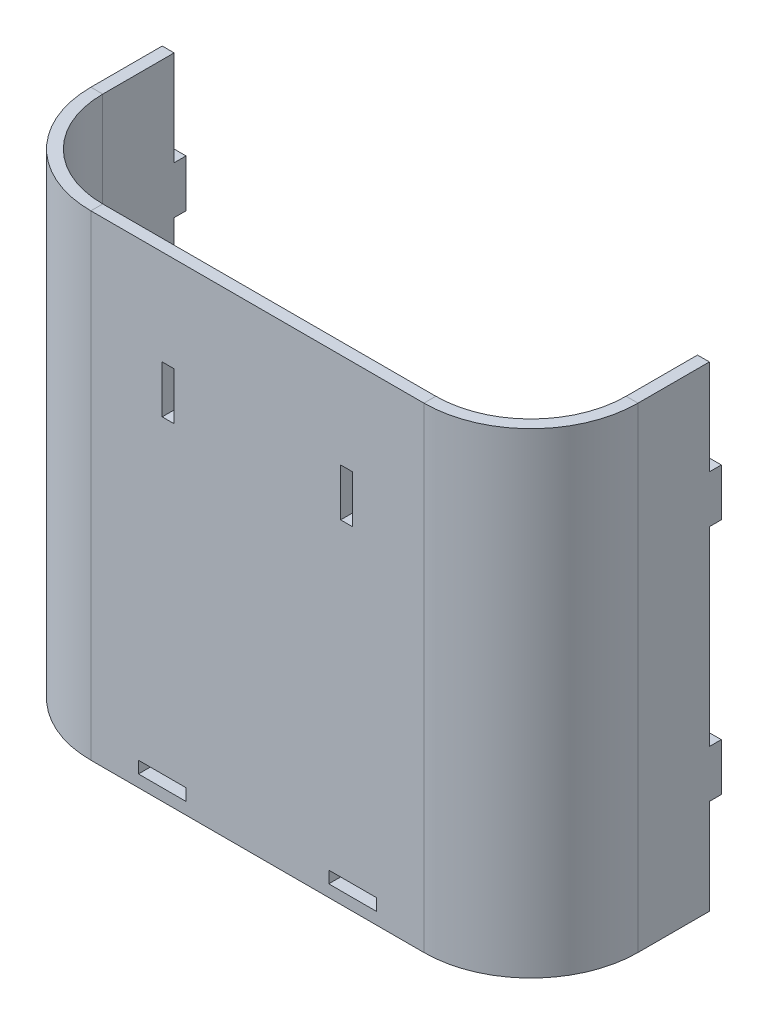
ISO-10303-21;
HEADER;
FILE_DESCRIPTION(('STEP AP214'),'2;1');
FILE_NAME('part.step','',(''),(''),'','','');
FILE_SCHEMA(('AUTOMOTIVE_DESIGN { 1 0 10303 214 1 1 1 1 }'));
ENDSEC;
DATA;
#1=APPLICATION_CONTEXT('core data for automotive mechanical design processes');
#2=APPLICATION_PROTOCOL_DEFINITION('international standard','automotive_design',2000,#1);
#3=PRODUCT_CONTEXT('',#1,'mechanical');
#4=PRODUCT('Part','Part','',(#3));
#5=PRODUCT_RELATED_PRODUCT_CATEGORY('part','',(#4));
#6=PRODUCT_DEFINITION_FORMATION('','',#4);
#7=PRODUCT_DEFINITION_CONTEXT('part definition',#1,'design');
#8=PRODUCT_DEFINITION('design','',#6,#7);
#9=PRODUCT_DEFINITION_SHAPE('','',#8);
#10=(LENGTH_UNIT() NAMED_UNIT(*) SI_UNIT(.MILLI.,.METRE.));
#11=(NAMED_UNIT(*) PLANE_ANGLE_UNIT() SI_UNIT($,.RADIAN.));
#12=(NAMED_UNIT(*) SI_UNIT($,.STERADIAN.) SOLID_ANGLE_UNIT());
#13=UNCERTAINTY_MEASURE_WITH_UNIT(LENGTH_MEASURE(1.E-05),#10,'distance_accuracy_value','');
#14=(GEOMETRIC_REPRESENTATION_CONTEXT(3) GLOBAL_UNCERTAINTY_ASSIGNED_CONTEXT((#13)) GLOBAL_UNIT_ASSIGNED_CONTEXT((#10,
#11,#12)) REPRESENTATION_CONTEXT('',''));
#15=CARTESIAN_POINT('',(0.,0.,0.));
#16=DIRECTION('',(0.,0.,1.));
#17=DIRECTION('',(1.,0.,0.));
#18=AXIS2_PLACEMENT_3D('',#15,#16,#17);
#19=CARTESIAN_POINT('',(73.0250000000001,63.5,-47.625));
#20=DIRECTION('',(0.,0.,1.));
#21=DIRECTION('',(1.,0.,0.));
#22=AXIS2_PLACEMENT_3D('',#19,#20,#21);
#23=PLANE('',#22);
#24=DIRECTION('',(1.,0.,0.));
#25=VECTOR('',#24,1.);
#26=CARTESIAN_POINT('',(69.8500000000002,-25.4,-47.625));
#27=LINE('',#26,#25);
#28=CARTESIAN_POINT('',(69.8500000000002,-25.4,-47.625));
#29=VERTEX_POINT('',#28);
#30=CARTESIAN_POINT('',(73.0250000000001,-25.4,-47.625));
#31=VERTEX_POINT('',#30);
#32=EDGE_CURVE('E97',#29,#31,#27,.T.);
#33=ORIENTED_EDGE('',*,*,#32,.F.);
#34=DIRECTION('',(0.,-1.,0.));
#35=VECTOR('',#34,1.);
#36=CARTESIAN_POINT('',(69.8500000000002,63.5,-47.625));
#37=LINE('',#36,#35);
#38=CARTESIAN_POINT('',(69.8500000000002,25.4,-47.625));
#39=VERTEX_POINT('',#38);
#40=EDGE_CURVE('E391',#29,#39,#37,.F.);
#41=ORIENTED_EDGE('',*,*,#40,.T.);
#42=DIRECTION('',(1.,0.,0.));
#43=VECTOR('',#42,1.);
#44=CARTESIAN_POINT('',(69.8500000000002,25.4,-47.625));
#45=LINE('',#44,#43);
#46=CARTESIAN_POINT('',(73.0250000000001,25.4,-47.625));
#47=VERTEX_POINT('',#46);
#48=EDGE_CURVE('E435',#39,#47,#45,.T.);
#49=ORIENTED_EDGE('',*,*,#48,.T.);
#50=DIRECTION('',(0.,1.,0.));
#51=VECTOR('',#50,1.);
#52=CARTESIAN_POINT('',(73.0250000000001,0.,-47.625));
#53=LINE('',#52,#51);
#54=EDGE_CURVE('E83',#31,#47,#53,.T.);
#55=ORIENTED_EDGE('',*,*,#54,.F.);
#56=EDGE_LOOP('',(#33,#41,#49,#55));
#57=FACE_BOUND('',#56,.T.);
#58=ADVANCED_FACE('F79',(#57),#23,.F.);
#59=DIRECTION('',(1.,0.,0.));
#60=VECTOR('',#59,1.);
#61=CARTESIAN_POINT('',(69.8500000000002,-38.1,-47.625));
#62=LINE('',#61,#60);
#63=CARTESIAN_POINT('',(69.8500000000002,-38.1,-47.625));
#64=VERTEX_POINT('',#63);
#65=CARTESIAN_POINT('',(73.0250000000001,-38.1,-47.625));
#66=VERTEX_POINT('',#65);
#67=EDGE_CURVE('E377',#64,#66,#62,.T.);
#68=ORIENTED_EDGE('',*,*,#67,.T.);
#69=CARTESIAN_POINT('',(73.0250000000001,-63.5,-47.625));
#70=VERTEX_POINT('',#69);
#71=EDGE_CURVE('E476',#70,#66,#53,.T.);
#72=ORIENTED_EDGE('',*,*,#71,.F.);
#73=DIRECTION('',(-1.,0.,0.));
#74=VECTOR('',#73,1.);
#75=CARTESIAN_POINT('',(73.0250000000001,-63.5,-47.625));
#76=LINE('',#75,#74);
#77=CARTESIAN_POINT('',(69.8500000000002,-63.5,-47.625));
#78=VERTEX_POINT('',#77);
#79=EDGE_CURVE('E389',#70,#78,#76,.T.);
#80=ORIENTED_EDGE('',*,*,#79,.T.);
#81=EDGE_CURVE('E367',#78,#64,#37,.F.);
#82=ORIENTED_EDGE('',*,*,#81,.T.);
#83=EDGE_LOOP('',(#68,#72,#80,#82));
#84=FACE_BOUND('',#83,.T.);
#85=ADVANCED_FACE('F387',(#84),#23,.F.);
#86=DIRECTION('',(1.,0.,0.));
#87=VECTOR('',#86,1.);
#88=CARTESIAN_POINT('',(69.8500000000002,38.1,-47.625));
#89=LINE('',#88,#87);
#90=CARTESIAN_POINT('',(69.8500000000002,38.1,-47.625));
#91=VERTEX_POINT('',#90);
#92=CARTESIAN_POINT('',(73.0250000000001,38.1,-47.625));
#93=VERTEX_POINT('',#92);
#94=EDGE_CURVE('E418',#91,#93,#89,.T.);
#95=ORIENTED_EDGE('',*,*,#94,.F.);
#96=CARTESIAN_POINT('',(69.8500000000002,63.5,-47.625));
#97=VERTEX_POINT('',#96);
#98=EDGE_CURVE('E396',#91,#97,#37,.F.);
#99=ORIENTED_EDGE('',*,*,#98,.T.);
#100=DIRECTION('',(-1.,0.,0.));
#101=VECTOR('',#100,1.);
#102=CARTESIAN_POINT('',(73.0250000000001,63.5,-47.625));
#103=LINE('',#102,#101);
#104=CARTESIAN_POINT('',(73.0250000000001,63.5,-47.625));
#105=VERTEX_POINT('',#104);
#106=EDGE_CURVE('E480',#105,#97,#103,.T.);
#107=ORIENTED_EDGE('',*,*,#106,.F.);
#108=EDGE_CURVE('E444',#93,#105,#53,.T.);
#109=ORIENTED_EDGE('',*,*,#108,.F.);
#110=EDGE_LOOP('',(#95,#99,#107,#109));
#111=FACE_BOUND('',#110,.T.);
#112=ADVANCED_FACE('F493',(#111),#23,.F.);
#113=CARTESIAN_POINT('',(0.,0.,-3.175));
#114=DIRECTION('',(0.,0.,-1.));
#115=DIRECTION('',(-1.,0.,0.));
#116=AXIS2_PLACEMENT_3D('',#113,#114,#115);
#117=PLANE('',#116);
#118=DIRECTION('',(0.,-1.,0.));
#119=VECTOR('',#118,1.);
#120=CARTESIAN_POINT('',(-19.05,0.,-3.175));
#121=LINE('',#120,#119);
#122=CARTESIAN_POINT('',(-19.05,-57.15,-3.175));
#123=VERTEX_POINT('',#122);
#124=CARTESIAN_POINT('',(-19.05,-60.325,-3.175));
#125=VERTEX_POINT('',#124);
#126=EDGE_CURVE('E1413',#123,#125,#121,.T.);
#127=ORIENTED_EDGE('',*,*,#126,.F.);
#128=DIRECTION('',(1.,0.,0.));
#129=VECTOR('',#128,1.);
#130=CARTESIAN_POINT('',(0.,-57.15,-3.175));
#131=LINE('',#130,#129);
#132=CARTESIAN_POINT('',(-31.75,-57.15,-3.175));
#133=VERTEX_POINT('',#132);
#134=EDGE_CURVE('E1402',#133,#123,#131,.T.);
#135=ORIENTED_EDGE('',*,*,#134,.F.);
#136=DIRECTION('',(0.,1.,0.));
#137=VECTOR('',#136,1.);
#138=CARTESIAN_POINT('',(-31.75,0.,-3.175));
#139=LINE('',#138,#137);
#140=CARTESIAN_POINT('',(-31.75,-60.325,-3.175));
#141=VERTEX_POINT('',#140);
#142=EDGE_CURVE('E1410',#141,#133,#139,.T.);
#143=ORIENTED_EDGE('',*,*,#142,.F.);
#144=DIRECTION('',(-1.,0.,0.));
#145=VECTOR('',#144,1.);
#146=CARTESIAN_POINT('',(0.,-60.325,-3.175));
#147=LINE('',#146,#145);
#148=EDGE_CURVE('E1419',#125,#141,#147,.T.);
#149=ORIENTED_EDGE('',*,*,#148,.F.);
#150=EDGE_LOOP('',(#127,#135,#143,#149));
#151=FACE_BOUND('',#150,.T.);
#152=DIRECTION('',(0.,-1.,0.));
#153=VECTOR('',#152,1.);
#154=CARTESIAN_POINT('',(-22.225,0.,-3.175));
#155=LINE('',#154,#153);
#156=CARTESIAN_POINT('',(-22.225,38.1,-3.175));
#157=VERTEX_POINT('',#156);
#158=CARTESIAN_POINT('',(-22.225,25.4,-3.175));
#159=VERTEX_POINT('',#158);
#160=EDGE_CURVE('E797',#157,#159,#155,.T.);
#161=ORIENTED_EDGE('',*,*,#160,.F.);
#162=DIRECTION('',(1.,0.,0.));
#163=VECTOR('',#162,1.);
#164=CARTESIAN_POINT('',(0.,38.1,-3.175));
#165=LINE('',#164,#163);
#166=CARTESIAN_POINT('',(-25.4,38.1,-3.175));
#167=VERTEX_POINT('',#166);
#168=EDGE_CURVE('E1438',#167,#157,#165,.T.);
#169=ORIENTED_EDGE('',*,*,#168,.F.);
#170=DIRECTION('',(0.,1.,0.));
#171=VECTOR('',#170,1.);
#172=CARTESIAN_POINT('',(-25.4,0.,-3.175));
#173=LINE('',#172,#171);
#174=CARTESIAN_POINT('',(-25.4,25.4,-3.175));
#175=VERTEX_POINT('',#174);
#176=EDGE_CURVE('E1446',#175,#167,#173,.T.);
#177=ORIENTED_EDGE('',*,*,#176,.F.);
#178=DIRECTION('',(-1.,0.,0.));
#179=VECTOR('',#178,1.);
#180=CARTESIAN_POINT('',(0.,25.4,-3.175));
#181=LINE('',#180,#179);
#182=EDGE_CURVE('E1448',#159,#175,#181,.T.);
#183=ORIENTED_EDGE('',*,*,#182,.F.);
#184=EDGE_LOOP('',(#161,#169,#177,#183));
#185=FACE_BOUND('',#184,.T.);
#186=DIRECTION('',(1.,0.,0.));
#187=VECTOR('',#186,1.);
#188=CARTESIAN_POINT('',(-73.025,-63.5,-3.175));
#189=LINE('',#188,#187);
#190=CARTESIAN_POINT('',(-44.4500000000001,-63.5,-3.17500000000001));
#191=VERTEX_POINT('',#190);
#192=CARTESIAN_POINT('',(44.4500000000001,-63.5,-3.175));
#193=VERTEX_POINT('',#192);
#194=EDGE_CURVE('E13',#191,#193,#189,.T.);
#195=ORIENTED_EDGE('',*,*,#194,.F.);
#196=DIRECTION('',(0.,1.,0.));
#197=VECTOR('',#196,1.);
#198=CARTESIAN_POINT('',(-44.4500000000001,63.5,-3.17500000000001));
#199=LINE('',#198,#197);
#200=CARTESIAN_POINT('',(-44.4500000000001,63.5,-3.17500000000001));
#201=VERTEX_POINT('',#200);
#202=EDGE_CURVE('E764',#201,#191,#199,.F.);
#203=ORIENTED_EDGE('',*,*,#202,.F.);
#204=DIRECTION('',(-1.,0.,0.));
#205=VECTOR('',#204,1.);
#206=CARTESIAN_POINT('',(-73.025,63.5,-3.175));
#207=LINE('',#206,#205);
#208=CARTESIAN_POINT('',(44.4500000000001,63.5,-3.175));
#209=VERTEX_POINT('',#208);
#210=EDGE_CURVE('E89',#209,#201,#207,.T.);
#211=ORIENTED_EDGE('',*,*,#210,.F.);
#212=DIRECTION('',(0.,-1.,0.));
#213=VECTOR('',#212,1.);
#214=CARTESIAN_POINT('',(44.4500000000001,-63.5,-3.17500000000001));
#215=LINE('',#214,#213);
#216=EDGE_CURVE('E523',#193,#209,#215,.F.);
#217=ORIENTED_EDGE('',*,*,#216,.F.);
#218=EDGE_LOOP('',(#195,#203,#211,#217));
#219=FACE_BOUND('',#218,.T.);
#220=DIRECTION('',(-1.,0.,0.));
#221=VECTOR('',#220,1.);
#222=CARTESIAN_POINT('',(0.,38.1,-3.175));
#223=LINE('',#222,#221);
#224=CARTESIAN_POINT('',(25.4,38.1,-3.175));
#225=VERTEX_POINT('',#224);
#226=CARTESIAN_POINT('',(22.225,38.1,-3.175));
#227=VERTEX_POINT('',#226);
#228=EDGE_CURVE('E631',#225,#227,#223,.T.);
#229=ORIENTED_EDGE('',*,*,#228,.T.);
#230=DIRECTION('',(0.,-1.,0.));
#231=VECTOR('',#230,1.);
#232=CARTESIAN_POINT('',(22.225,0.,-3.175));
#233=LINE('',#232,#231);
#234=CARTESIAN_POINT('',(22.225,25.4,-3.175));
#235=VERTEX_POINT('',#234);
#236=EDGE_CURVE('E621',#227,#235,#233,.T.);
#237=ORIENTED_EDGE('',*,*,#236,.T.);
#238=DIRECTION('',(1.,0.,0.));
#239=VECTOR('',#238,1.);
#240=CARTESIAN_POINT('',(0.,25.4,-3.175));
#241=LINE('',#240,#239);
#242=CARTESIAN_POINT('',(25.4,25.4,-3.175));
#243=VERTEX_POINT('',#242);
#244=EDGE_CURVE('E637',#235,#243,#241,.T.);
#245=ORIENTED_EDGE('',*,*,#244,.T.);
#246=DIRECTION('',(0.,1.,0.));
#247=VECTOR('',#246,1.);
#248=CARTESIAN_POINT('',(25.4,0.,-3.175));
#249=LINE('',#248,#247);
#250=EDGE_CURVE('E634',#243,#225,#249,.T.);
#251=ORIENTED_EDGE('',*,*,#250,.T.);
#252=EDGE_LOOP('',(#229,#237,#245,#251));
#253=FACE_BOUND('',#252,.T.);
#254=DIRECTION('',(-1.,0.,0.));
#255=VECTOR('',#254,1.);
#256=CARTESIAN_POINT('',(0.,-57.15,-3.175));
#257=LINE('',#256,#255);
#258=CARTESIAN_POINT('',(31.75,-57.15,-3.175));
#259=VERTEX_POINT('',#258);
#260=CARTESIAN_POINT('',(19.05,-57.15,-3.175));
#261=VERTEX_POINT('',#260);
#262=EDGE_CURVE('E664',#259,#261,#257,.T.);
#263=ORIENTED_EDGE('',*,*,#262,.T.);
#264=DIRECTION('',(0.,-1.,0.));
#265=VECTOR('',#264,1.);
#266=CARTESIAN_POINT('',(19.05,0.,-3.175));
#267=LINE('',#266,#265);
#268=CARTESIAN_POINT('',(19.05,-60.325,-3.175));
#269=VERTEX_POINT('',#268);
#270=EDGE_CURVE('E661',#261,#269,#267,.T.);
#271=ORIENTED_EDGE('',*,*,#270,.T.);
#272=DIRECTION('',(1.,0.,0.));
#273=VECTOR('',#272,1.);
#274=CARTESIAN_POINT('',(0.,-60.325,-3.175));
#275=LINE('',#274,#273);
#276=CARTESIAN_POINT('',(31.75,-60.325,-3.175));
#277=VERTEX_POINT('',#276);
#278=EDGE_CURVE('E670',#269,#277,#275,.T.);
#279=ORIENTED_EDGE('',*,*,#278,.T.);
#280=DIRECTION('',(0.,1.,0.));
#281=VECTOR('',#280,1.);
#282=CARTESIAN_POINT('',(31.75,0.,-3.175));
#283=LINE('',#282,#281);
#284=EDGE_CURVE('E667',#277,#259,#283,.T.);
#285=ORIENTED_EDGE('',*,*,#284,.T.);
#286=EDGE_LOOP('',(#263,#271,#279,#285));
#287=FACE_BOUND('',#286,.T.);
#288=ADVANCED_FACE('F702',(#151,#185,#219,#253,#287),#117,.T.);
#289=CARTESIAN_POINT('',(0.,0.,0.));
#290=DIRECTION('',(0.,0.,-1.));
#291=DIRECTION('',(-1.,0.,0.));
#292=AXIS2_PLACEMENT_3D('',#289,#290,#291);
#293=PLANE('',#292);
#294=DIRECTION('',(0.,1.,0.));
#295=VECTOR('',#294,1.);
#296=CARTESIAN_POINT('',(22.225,38.1,0.));
#297=LINE('',#296,#295);
#298=CARTESIAN_POINT('',(22.225,25.4,0.));
#299=VERTEX_POINT('',#298);
#300=CARTESIAN_POINT('',(22.225,38.1,0.));
#301=VERTEX_POINT('',#300);
#302=EDGE_CURVE('E658',#299,#301,#297,.T.);
#303=ORIENTED_EDGE('',*,*,#302,.T.);
#304=DIRECTION('',(1.,0.,0.));
#305=VECTOR('',#304,1.);
#306=CARTESIAN_POINT('',(25.4,38.1,0.));
#307=LINE('',#306,#305);
#308=CARTESIAN_POINT('',(25.4,38.1,0.));
#309=VERTEX_POINT('',#308);
#310=EDGE_CURVE('E645',#301,#309,#307,.T.);
#311=ORIENTED_EDGE('',*,*,#310,.T.);
#312=DIRECTION('',(0.,-1.,0.));
#313=VECTOR('',#312,1.);
#314=CARTESIAN_POINT('',(25.4,38.1,0.));
#315=LINE('',#314,#313);
#316=CARTESIAN_POINT('',(25.4,25.4,0.));
#317=VERTEX_POINT('',#316);
#318=EDGE_CURVE('E652',#309,#317,#315,.T.);
#319=ORIENTED_EDGE('',*,*,#318,.T.);
#320=DIRECTION('',(-1.,0.,0.));
#321=VECTOR('',#320,1.);
#322=CARTESIAN_POINT('',(25.4,25.4,0.));
#323=LINE('',#322,#321);
#324=EDGE_CURVE('E655',#317,#299,#323,.T.);
#325=ORIENTED_EDGE('',*,*,#324,.T.);
#326=EDGE_LOOP('',(#303,#311,#319,#325));
#327=FACE_BOUND('',#326,.T.);
#328=DIRECTION('',(-1.,0.,0.));
#329=VECTOR('',#328,1.);
#330=CARTESIAN_POINT('',(-31.75,-57.15,0.));
#331=LINE('',#330,#329);
#332=CARTESIAN_POINT('',(-19.05,-57.15,0.));
#333=VERTEX_POINT('',#332);
#334=CARTESIAN_POINT('',(-31.75,-57.15,0.));
#335=VERTEX_POINT('',#334);
#336=EDGE_CURVE('E1470',#333,#335,#331,.T.);
#337=ORIENTED_EDGE('',*,*,#336,.F.);
#338=DIRECTION('',(0.,1.,0.));
#339=VECTOR('',#338,1.);
#340=CARTESIAN_POINT('',(-19.05,-60.325,0.));
#341=LINE('',#340,#339);
#342=CARTESIAN_POINT('',(-19.05,-60.325,0.));
#343=VERTEX_POINT('',#342);
#344=EDGE_CURVE('E573',#343,#333,#341,.T.);
#345=ORIENTED_EDGE('',*,*,#344,.F.);
#346=DIRECTION('',(1.,0.,0.));
#347=VECTOR('',#346,1.);
#348=CARTESIAN_POINT('',(-31.75,-60.325,0.));
#349=LINE('',#348,#347);
#350=CARTESIAN_POINT('',(-31.75,-60.325,0.));
#351=VERTEX_POINT('',#350);
#352=EDGE_CURVE('E1416',#351,#343,#349,.T.);
#353=ORIENTED_EDGE('',*,*,#352,.F.);
#354=DIRECTION('',(0.,-1.,0.));
#355=VECTOR('',#354,1.);
#356=CARTESIAN_POINT('',(-31.75,-60.325,0.));
#357=LINE('',#356,#355);
#358=EDGE_CURVE('E1468',#335,#351,#357,.T.);
#359=ORIENTED_EDGE('',*,*,#358,.F.);
#360=EDGE_LOOP('',(#337,#345,#353,#359));
#361=FACE_BOUND('',#360,.T.);
#362=DIRECTION('',(-1.,0.,0.));
#363=VECTOR('',#362,1.);
#364=CARTESIAN_POINT('',(-25.4,38.1,0.));
#365=LINE('',#364,#363);
#366=CARTESIAN_POINT('',(-22.225,38.1,0.));
#367=VERTEX_POINT('',#366);
#368=CARTESIAN_POINT('',(-25.4,38.1,0.));
#369=VERTEX_POINT('',#368);
#370=EDGE_CURVE('E1422',#367,#369,#365,.T.);
#371=ORIENTED_EDGE('',*,*,#370,.F.);
#372=DIRECTION('',(0.,1.,0.));
#373=VECTOR('',#372,1.);
#374=CARTESIAN_POINT('',(-22.225,38.1,0.));
#375=LINE('',#374,#373);
#376=CARTESIAN_POINT('',(-22.225,25.4,0.));
#377=VERTEX_POINT('',#376);
#378=EDGE_CURVE('E1420',#377,#367,#375,.T.);
#379=ORIENTED_EDGE('',*,*,#378,.F.);
#380=DIRECTION('',(1.,0.,0.));
#381=VECTOR('',#380,1.);
#382=CARTESIAN_POINT('',(-25.4,25.4,0.));
#383=LINE('',#382,#381);
#384=CARTESIAN_POINT('',(-25.4,25.4,0.));
#385=VERTEX_POINT('',#384);
#386=EDGE_CURVE('E1432',#385,#377,#383,.T.);
#387=ORIENTED_EDGE('',*,*,#386,.F.);
#388=DIRECTION('',(0.,-1.,0.));
#389=VECTOR('',#388,1.);
#390=CARTESIAN_POINT('',(-25.4,38.1,0.));
#391=LINE('',#390,#389);
#392=EDGE_CURVE('E1429',#369,#385,#391,.T.);
#393=ORIENTED_EDGE('',*,*,#392,.F.);
#394=EDGE_LOOP('',(#371,#379,#387,#393));
#395=FACE_BOUND('',#394,.T.);
#396=DIRECTION('',(0.,1.,0.));
#397=VECTOR('',#396,1.);
#398=CARTESIAN_POINT('',(-44.4500000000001,63.5,0.));
#399=LINE('',#398,#397);
#400=CARTESIAN_POINT('',(-44.4500000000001,63.5,0.));
#401=VERTEX_POINT('',#400);
#402=CARTESIAN_POINT('',(-44.4500000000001,-63.5,0.));
#403=VERTEX_POINT('',#402);
#404=EDGE_CURVE('E781',#401,#403,#399,.F.);
#405=ORIENTED_EDGE('',*,*,#404,.T.);
#406=DIRECTION('',(1.,0.,0.));
#407=VECTOR('',#406,1.);
#408=CARTESIAN_POINT('',(-73.025,-63.5,0.));
#409=LINE('',#408,#407);
#410=CARTESIAN_POINT('',(44.4500000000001,-63.5,0.));
#411=VERTEX_POINT('',#410);
#412=EDGE_CURVE('E535',#403,#411,#409,.T.);
#413=ORIENTED_EDGE('',*,*,#412,.T.);
#414=DIRECTION('',(0.,-1.,0.));
#415=VECTOR('',#414,1.);
#416=CARTESIAN_POINT('',(44.4500000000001,-63.5,0.));
#417=LINE('',#416,#415);
#418=CARTESIAN_POINT('',(44.4500000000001,63.5,0.));
#419=VERTEX_POINT('',#418);
#420=EDGE_CURVE('E513',#411,#419,#417,.F.);
#421=ORIENTED_EDGE('',*,*,#420,.T.);
#422=DIRECTION('',(-1.,0.,0.));
#423=VECTOR('',#422,1.);
#424=CARTESIAN_POINT('',(-73.025,63.5,0.));
#425=LINE('',#424,#423);
#426=EDGE_CURVE('E532',#419,#401,#425,.T.);
#427=ORIENTED_EDGE('',*,*,#426,.T.);
#428=EDGE_LOOP('',(#405,#413,#421,#427));
#429=FACE_BOUND('',#428,.T.);
#430=DIRECTION('',(0.,1.,0.));
#431=VECTOR('',#430,1.);
#432=CARTESIAN_POINT('',(19.05,-60.325,0.));
#433=LINE('',#432,#431);
#434=CARTESIAN_POINT('',(19.05,-60.325,0.));
#435=VERTEX_POINT('',#434);
#436=CARTESIAN_POINT('',(19.05,-57.15,0.));
#437=VERTEX_POINT('',#436);
#438=EDGE_CURVE('E422',#435,#437,#433,.T.);
#439=ORIENTED_EDGE('',*,*,#438,.T.);
#440=DIRECTION('',(1.,0.,0.));
#441=VECTOR('',#440,1.);
#442=CARTESIAN_POINT('',(31.75,-57.15,0.));
#443=LINE('',#442,#441);
#444=CARTESIAN_POINT('',(31.75,-57.15,0.));
#445=VERTEX_POINT('',#444);
#446=EDGE_CURVE('E678',#437,#445,#443,.T.);
#447=ORIENTED_EDGE('',*,*,#446,.T.);
#448=DIRECTION('',(0.,-1.,0.));
#449=VECTOR('',#448,1.);
#450=CARTESIAN_POINT('',(31.75,-60.325,0.));
#451=LINE('',#450,#449);
#452=CARTESIAN_POINT('',(31.75,-60.325,0.));
#453=VERTEX_POINT('',#452);
#454=EDGE_CURVE('E685',#445,#453,#451,.T.);
#455=ORIENTED_EDGE('',*,*,#454,.T.);
#456=DIRECTION('',(-1.,0.,0.));
#457=VECTOR('',#456,1.);
#458=CARTESIAN_POINT('',(31.75,-60.325,0.));
#459=LINE('',#458,#457);
#460=EDGE_CURVE('E687',#453,#435,#459,.T.);
#461=ORIENTED_EDGE('',*,*,#460,.T.);
#462=EDGE_LOOP('',(#439,#447,#455,#461));
#463=FACE_BOUND('',#462,.T.);
#464=ADVANCED_FACE('F692',(#327,#361,#395,#429,#463),#293,.F.);
#465=CARTESIAN_POINT('',(-73.0250000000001,-63.5,-47.625));
#466=DIRECTION('',(0.,0.,1.));
#467=DIRECTION('',(1.,0.,0.));
#468=AXIS2_PLACEMENT_3D('',#465,#466,#467);
#469=PLANE('',#468);
#470=DIRECTION('',(0.,-1.,0.));
#471=VECTOR('',#470,1.);
#472=CARTESIAN_POINT('',(-73.0250000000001,0.,-47.625));
#473=LINE('',#472,#471);
#474=CARTESIAN_POINT('',(-73.0250000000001,-38.1,-47.625));
#475=VERTEX_POINT('',#474);
#476=CARTESIAN_POINT('',(-73.0250000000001,-63.5,-47.625));
#477=VERTEX_POINT('',#476);
#478=EDGE_CURVE('E400',#475,#477,#473,.T.);
#479=ORIENTED_EDGE('',*,*,#478,.F.);
#480=DIRECTION('',(-1.,0.,0.));
#481=VECTOR('',#480,1.);
#482=CARTESIAN_POINT('',(-69.8500000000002,-38.1,-47.625));
#483=LINE('',#482,#481);
#484=CARTESIAN_POINT('',(-69.8500000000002,-38.1,-47.625));
#485=VERTEX_POINT('',#484);
#486=EDGE_CURVE('E607',#485,#475,#483,.T.);
#487=ORIENTED_EDGE('',*,*,#486,.F.);
#488=DIRECTION('',(0.,1.,0.));
#489=VECTOR('',#488,1.);
#490=CARTESIAN_POINT('',(-69.8500000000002,-63.5,-47.625));
#491=LINE('',#490,#489);
#492=CARTESIAN_POINT('',(-69.8500000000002,-63.5,-47.625));
#493=VERTEX_POINT('',#492);
#494=EDGE_CURVE('E555',#485,#493,#491,.F.);
#495=ORIENTED_EDGE('',*,*,#494,.T.);
#496=DIRECTION('',(1.,0.,0.));
#497=VECTOR('',#496,1.);
#498=CARTESIAN_POINT('',(-73.0250000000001,-63.5,-47.625));
#499=LINE('',#498,#497);
#500=EDGE_CURVE('E819',#477,#493,#499,.T.);
#501=ORIENTED_EDGE('',*,*,#500,.F.);
#502=EDGE_LOOP('',(#479,#487,#495,#501));
#503=FACE_BOUND('',#502,.T.);
#504=ADVANCED_FACE('F735',(#503),#469,.F.);
#505=CARTESIAN_POINT('',(-69.8500000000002,25.4,-47.625));
#506=VERTEX_POINT('',#505);
#507=CARTESIAN_POINT('',(-69.8500000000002,-25.4,-47.625));
#508=VERTEX_POINT('',#507);
#509=EDGE_CURVE('E545',#506,#508,#491,.F.);
#510=ORIENTED_EDGE('',*,*,#509,.T.);
#511=DIRECTION('',(-1.,0.,0.));
#512=VECTOR('',#511,1.);
#513=CARTESIAN_POINT('',(-69.8500000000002,-25.4,-47.625));
#514=LINE('',#513,#512);
#515=CARTESIAN_POINT('',(-73.0250000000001,-25.4,-47.625));
#516=VERTEX_POINT('',#515);
#517=EDGE_CURVE('E600',#508,#516,#514,.T.);
#518=ORIENTED_EDGE('',*,*,#517,.T.);
#519=CARTESIAN_POINT('',(-73.0250000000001,25.4,-47.625));
#520=VERTEX_POINT('',#519);
#521=EDGE_CURVE('E833',#520,#516,#473,.T.);
#522=ORIENTED_EDGE('',*,*,#521,.F.);
#523=DIRECTION('',(-1.,0.,0.));
#524=VECTOR('',#523,1.);
#525=CARTESIAN_POINT('',(-69.8500000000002,25.4,-47.625));
#526=LINE('',#525,#524);
#527=EDGE_CURVE('E570',#506,#520,#526,.T.);
#528=ORIENTED_EDGE('',*,*,#527,.F.);
#529=EDGE_LOOP('',(#510,#518,#522,#528));
#530=FACE_BOUND('',#529,.T.);
#531=ADVANCED_FACE('F751',(#530),#469,.F.);
#532=CARTESIAN_POINT('',(-73.025,63.5,-3.175));
#533=DIRECTION('',(0.,1.,0.));
#534=DIRECTION('',(0.,0.,1.));
#535=AXIS2_PLACEMENT_3D('',#532,#533,#534);
#536=PLANE('',#535);
#537=ORIENTED_EDGE('',*,*,#210,.T.);
#538=DIRECTION('',(0.,0.,1.));
#539=VECTOR('',#538,1.);
#540=CARTESIAN_POINT('',(-44.4500000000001,63.5,-3.17500000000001));
#541=LINE('',#540,#539);
#542=EDGE_CURVE('E509',#201,#401,#541,.T.);
#543=ORIENTED_EDGE('',*,*,#542,.T.);
#544=ORIENTED_EDGE('',*,*,#426,.F.);
#545=DIRECTION('',(0.,0.,1.));
#546=VECTOR('',#545,1.);
#547=CARTESIAN_POINT('',(44.4500000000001,63.5,-3.17500000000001));
#548=LINE('',#547,#546);
#549=EDGE_CURVE('E529',#209,#419,#548,.T.);
#550=ORIENTED_EDGE('',*,*,#549,.F.);
#551=EDGE_LOOP('',(#537,#543,#544,#550));
#552=FACE_BOUND('',#551,.T.);
#553=ADVANCED_FACE('F81',(#552),#536,.T.);
#554=CARTESIAN_POINT('',(-73.025,-63.5,-3.175));
#555=DIRECTION('',(0.,-1.,0.));
#556=DIRECTION('',(0.,0.,-1.));
#557=AXIS2_PLACEMENT_3D('',#554,#555,#556);
#558=PLANE('',#557);
#559=DIRECTION('',(0.,0.,1.));
#560=VECTOR('',#559,1.);
#561=CARTESIAN_POINT('',(-44.4500000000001,-63.5,-3.17500000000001));
#562=LINE('',#561,#560);
#563=EDGE_CURVE('E504',#191,#403,#562,.T.);
#564=ORIENTED_EDGE('',*,*,#563,.F.);
#565=ORIENTED_EDGE('',*,*,#194,.T.);
#566=DIRECTION('',(0.,0.,1.));
#567=VECTOR('',#566,1.);
#568=CARTESIAN_POINT('',(44.4500000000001,-63.5,-3.17500000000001));
#569=LINE('',#568,#567);
#570=EDGE_CURVE('E518',#193,#411,#569,.T.);
#571=ORIENTED_EDGE('',*,*,#570,.T.);
#572=ORIENTED_EDGE('',*,*,#412,.F.);
#573=EDGE_LOOP('',(#564,#565,#571,#572));
#574=FACE_BOUND('',#573,.T.);
#575=ADVANCED_FACE('F743',(#574),#558,.T.);
#576=CARTESIAN_POINT('',(44.4500000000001,63.5,-28.575));
#577=DIRECTION('',(0.,1.,0.));
#578=DIRECTION('',(-1.,0.,0.));
#579=AXIS2_PLACEMENT_3D('',#576,#577,#578);
#580=PLANE('',#579);
#581=DIRECTION('',(-1.,0.,0.));
#582=VECTOR('',#581,1.);
#583=CARTESIAN_POINT('',(73.0250000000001,63.5,-28.5749999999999));
#584=LINE('',#583,#582);
#585=CARTESIAN_POINT('',(69.8500000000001,63.5,-28.5749999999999));
#586=VERTEX_POINT('',#585);
#587=CARTESIAN_POINT('',(73.0250000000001,63.5,-28.5749999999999));
#588=VERTEX_POINT('',#587);
#589=EDGE_CURVE('E498',#586,#588,#584,.F.);
#590=ORIENTED_EDGE('',*,*,#589,.F.);
#591=CARTESIAN_POINT('',(44.4500000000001,63.5,-28.575));
#592=DIRECTION('',(0.,-1.,0.));
#593=DIRECTION('',(1.,0.,0.));
#594=AXIS2_PLACEMENT_3D('',#591,#592,#593);
#595=CIRCLE('',#594,25.4);
#596=EDGE_CURVE('E521',#209,#586,#595,.F.);
#597=ORIENTED_EDGE('',*,*,#596,.F.);
#598=ORIENTED_EDGE('',*,*,#549,.T.);
#599=CARTESIAN_POINT('',(44.4500000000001,63.5,-28.575));
#600=DIRECTION('',(0.,-1.,0.));
#601=DIRECTION('',(1.,0.,0.));
#602=AXIS2_PLACEMENT_3D('',#599,#600,#601);
#603=CIRCLE('',#602,28.575);
#604=EDGE_CURVE('E515',#419,#588,#603,.F.);
#605=ORIENTED_EDGE('',*,*,#604,.T.);
#606=EDGE_LOOP('',(#590,#597,#598,#605));
#607=FACE_BOUND('',#606,.T.);
#608=ADVANCED_FACE('F745',(#607),#580,.T.);
#609=CARTESIAN_POINT('',(44.4500000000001,-63.5,-28.575));
#610=DIRECTION('',(0.,1.,0.));
#611=DIRECTION('',(-1.,0.,0.));
#612=AXIS2_PLACEMENT_3D('',#609,#610,#611);
#613=PLANE('',#612);
#614=CARTESIAN_POINT('',(44.4500000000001,-63.5,-28.575));
#615=DIRECTION('',(0.,-1.,0.));
#616=DIRECTION('',(1.,0.,0.));
#617=AXIS2_PLACEMENT_3D('',#614,#615,#616);
#618=CIRCLE('',#617,25.4);
#619=CARTESIAN_POINT('',(69.8500000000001,-63.5,-28.5749999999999));
#620=VERTEX_POINT('',#619);
#621=EDGE_CURVE('E526',#620,#193,#618,.T.);
#622=ORIENTED_EDGE('',*,*,#621,.F.);
#623=DIRECTION('',(-1.,0.,0.));
#624=VECTOR('',#623,1.);
#625=CARTESIAN_POINT('',(69.8500000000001,-63.5,-28.5749999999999));
#626=LINE('',#625,#624);
#627=CARTESIAN_POINT('',(73.0250000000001,-63.5,-28.5749999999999));
#628=VERTEX_POINT('',#627);
#629=EDGE_CURVE('E506',#620,#628,#626,.F.);
#630=ORIENTED_EDGE('',*,*,#629,.T.);
#631=CARTESIAN_POINT('',(44.4500000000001,-63.5,-28.575));
#632=DIRECTION('',(0.,-1.,0.));
#633=DIRECTION('',(1.,0.,0.));
#634=AXIS2_PLACEMENT_3D('',#631,#632,#633);
#635=CIRCLE('',#634,28.575);
#636=EDGE_CURVE('E516',#628,#411,#635,.T.);
#637=ORIENTED_EDGE('',*,*,#636,.T.);
#638=ORIENTED_EDGE('',*,*,#570,.F.);
#639=EDGE_LOOP('',(#622,#630,#637,#638));
#640=FACE_BOUND('',#639,.T.);
#641=ADVANCED_FACE('F741',(#640),#613,.F.);
#642=CARTESIAN_POINT('',(44.4500000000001,-63.5,-28.575));
#643=DIRECTION('',(0.,-1.,0.));
#644=DIRECTION('',(1.,0.,0.));
#645=AXIS2_PLACEMENT_3D('',#642,#643,#644);
#646=CYLINDRICAL_SURFACE('',#645,28.575);
#647=ORIENTED_EDGE('',*,*,#420,.F.);
#648=ORIENTED_EDGE('',*,*,#636,.F.);
#649=DIRECTION('',(0.,-1.,0.));
#650=VECTOR('',#649,1.);
#651=CARTESIAN_POINT('',(73.0250000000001,63.5,-28.5749999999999));
#652=LINE('',#651,#650);
#653=EDGE_CURVE('E855',#628,#588,#652,.F.);
#654=ORIENTED_EDGE('',*,*,#653,.T.);
#655=ORIENTED_EDGE('',*,*,#604,.F.);
#656=EDGE_LOOP('',(#647,#648,#654,#655));
#657=FACE_BOUND('',#656,.T.);
#658=ADVANCED_FACE('F854',(#657),#646,.T.);
#659=CARTESIAN_POINT('',(44.4500000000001,-63.5,-28.575));
#660=DIRECTION('',(0.,-1.,0.));
#661=DIRECTION('',(1.,0.,0.));
#662=AXIS2_PLACEMENT_3D('',#659,#660,#661);
#663=CYLINDRICAL_SURFACE('',#662,25.4);
#664=ORIENTED_EDGE('',*,*,#216,.T.);
#665=ORIENTED_EDGE('',*,*,#596,.T.);
#666=DIRECTION('',(0.,-1.,0.));
#667=VECTOR('',#666,1.);
#668=CARTESIAN_POINT('',(69.8500000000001,63.5,-28.5749999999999));
#669=LINE('',#668,#667);
#670=EDGE_CURVE('E503',#586,#620,#669,.T.);
#671=ORIENTED_EDGE('',*,*,#670,.T.);
#672=ORIENTED_EDGE('',*,*,#621,.T.);
#673=EDGE_LOOP('',(#664,#665,#671,#672));
#674=FACE_BOUND('',#673,.T.);
#675=ADVANCED_FACE('F864',(#674),#663,.F.);
#676=CARTESIAN_POINT('',(73.0250000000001,-63.5,-47.625));
#677=DIRECTION('',(0.,1.,0.));
#678=DIRECTION('',(0.,0.,1.));
#679=AXIS2_PLACEMENT_3D('',#676,#677,#678);
#680=PLANE('',#679);
#681=ORIENTED_EDGE('',*,*,#629,.F.);
#682=DIRECTION('',(0.,0.,1.));
#683=VECTOR('',#682,1.);
#684=CARTESIAN_POINT('',(69.8500000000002,-63.5,-47.625));
#685=LINE('',#684,#683);
#686=EDGE_CURVE('E407',#620,#78,#685,.F.);
#687=ORIENTED_EDGE('',*,*,#686,.T.);
#688=ORIENTED_EDGE('',*,*,#79,.F.);
#689=DIRECTION('',(0.,0.,-1.));
#690=VECTOR('',#689,1.);
#691=CARTESIAN_POINT('',(73.025,-63.5,2.42051493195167E-13));
#692=LINE('',#691,#690);
#693=EDGE_CURVE('E394',#628,#70,#692,.T.);
#694=ORIENTED_EDGE('',*,*,#693,.F.);
#695=EDGE_LOOP('',(#681,#687,#688,#694));
#696=FACE_BOUND('',#695,.T.);
#697=ADVANCED_FACE('F861',(#696),#680,.F.);
#698=CARTESIAN_POINT('',(73.025,63.5,-3.17499999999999));
#699=DIRECTION('',(0.,-1.,0.));
#700=DIRECTION('',(0.,0.,-1.));
#701=AXIS2_PLACEMENT_3D('',#698,#699,#700);
#702=PLANE('',#701);
#703=ORIENTED_EDGE('',*,*,#589,.T.);
#704=DIRECTION('',(0.,0.,1.));
#705=VECTOR('',#704,1.);
#706=CARTESIAN_POINT('',(73.025,63.5,2.61876904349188E-13));
#707=LINE('',#706,#705);
#708=EDGE_CURVE('E478',#105,#588,#707,.T.);
#709=ORIENTED_EDGE('',*,*,#708,.F.);
#710=ORIENTED_EDGE('',*,*,#106,.T.);
#711=DIRECTION('',(0.,0.,-1.));
#712=VECTOR('',#711,1.);
#713=CARTESIAN_POINT('',(69.85,63.5,-3.175));
#714=LINE('',#713,#712);
#715=EDGE_CURVE('E390',#97,#586,#714,.F.);
#716=ORIENTED_EDGE('',*,*,#715,.T.);
#717=EDGE_LOOP('',(#703,#709,#710,#716));
#718=FACE_BOUND('',#717,.T.);
#719=ADVANCED_FACE('F497',(#718),#702,.F.);
#720=CARTESIAN_POINT('',(73.025,0.,2.61876904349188E-13));
#721=DIRECTION('',(-1.,0.,0.));
#722=DIRECTION('',(0.,0.,1.));
#723=AXIS2_PLACEMENT_3D('',#720,#721,#722);
#724=PLANE('',#723);
#725=ORIENTED_EDGE('',*,*,#653,.F.);
#726=ORIENTED_EDGE('',*,*,#693,.T.);
#727=ORIENTED_EDGE('',*,*,#71,.T.);
#728=DIRECTION('',(0.,0.,1.));
#729=VECTOR('',#728,1.);
#730=CARTESIAN_POINT('',(73.0250000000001,-38.1,-47.625));
#731=LINE('',#730,#729);
#732=CARTESIAN_POINT('',(73.0250000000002,-38.1,-50.8));
#733=VERTEX_POINT('',#732);
#734=EDGE_CURVE('E380',#733,#66,#731,.T.);
#735=ORIENTED_EDGE('',*,*,#734,.F.);
#736=DIRECTION('',(0.,-1.,0.));
#737=VECTOR('',#736,1.);
#738=CARTESIAN_POINT('',(73.0250000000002,-25.4,-50.8));
#739=LINE('',#738,#737);
#740=CARTESIAN_POINT('',(73.0250000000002,-25.4,-50.8));
#741=VERTEX_POINT('',#740);
#742=EDGE_CURVE('E464',#741,#733,#739,.T.);
#743=ORIENTED_EDGE('',*,*,#742,.F.);
#744=DIRECTION('',(0.,0.,-1.));
#745=VECTOR('',#744,1.);
#746=CARTESIAN_POINT('',(73.0250000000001,-25.4,-47.625));
#747=LINE('',#746,#745);
#748=EDGE_CURVE('E374',#31,#741,#747,.T.);
#749=ORIENTED_EDGE('',*,*,#748,.F.);
#750=ORIENTED_EDGE('',*,*,#54,.T.);
#751=DIRECTION('',(0.,0.,1.));
#752=VECTOR('',#751,1.);
#753=CARTESIAN_POINT('',(73.0250000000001,25.4,-47.625));
#754=LINE('',#753,#752);
#755=CARTESIAN_POINT('',(73.0250000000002,25.4,-50.8));
#756=VERTEX_POINT('',#755);
#757=EDGE_CURVE('E445',#756,#47,#754,.T.);
#758=ORIENTED_EDGE('',*,*,#757,.F.);
#759=DIRECTION('',(0.,-1.,0.));
#760=VECTOR('',#759,1.);
#761=CARTESIAN_POINT('',(73.0250000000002,38.1,-50.8));
#762=LINE('',#761,#760);
#763=CARTESIAN_POINT('',(73.0250000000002,38.1,-50.8));
#764=VERTEX_POINT('',#763);
#765=EDGE_CURVE('E417',#764,#756,#762,.T.);
#766=ORIENTED_EDGE('',*,*,#765,.F.);
#767=DIRECTION('',(0.,0.,-1.));
#768=VECTOR('',#767,1.);
#769=CARTESIAN_POINT('',(73.0250000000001,38.1,-47.625));
#770=LINE('',#769,#768);
#771=EDGE_CURVE('E414',#93,#764,#770,.T.);
#772=ORIENTED_EDGE('',*,*,#771,.F.);
#773=ORIENTED_EDGE('',*,*,#108,.T.);
#774=ORIENTED_EDGE('',*,*,#708,.T.);
#775=EDGE_LOOP('',(#725,#726,#727,#735,#743,#749,#750,#758,#766,#772,#773,#774));
#776=FACE_BOUND('',#775,.T.);
#777=ADVANCED_FACE('F475',(#776),#724,.F.);
#778=CARTESIAN_POINT('',(69.85,0.,2.50791451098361E-13));
#779=DIRECTION('',(-1.,0.,0.));
#780=DIRECTION('',(0.,0.,1.));
#781=AXIS2_PLACEMENT_3D('',#778,#779,#780);
#782=PLANE('',#781);
#783=ORIENTED_EDGE('',*,*,#686,.F.);
#784=ORIENTED_EDGE('',*,*,#670,.F.);
#785=ORIENTED_EDGE('',*,*,#715,.F.);
#786=ORIENTED_EDGE('',*,*,#98,.F.);
#787=DIRECTION('',(0.,0.,-1.));
#788=VECTOR('',#787,1.);
#789=CARTESIAN_POINT('',(69.8500000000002,38.1,-47.625));
#790=LINE('',#789,#788);
#791=CARTESIAN_POINT('',(69.8500000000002,38.1,-50.8));
#792=VERTEX_POINT('',#791);
#793=EDGE_CURVE('E443',#91,#792,#790,.T.);
#794=ORIENTED_EDGE('',*,*,#793,.T.);
#795=DIRECTION('',(0.,-1.,0.));
#796=VECTOR('',#795,1.);
#797=CARTESIAN_POINT('',(69.8500000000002,38.1,-50.8));
#798=LINE('',#797,#796);
#799=CARTESIAN_POINT('',(69.8500000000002,25.4,-50.8));
#800=VERTEX_POINT('',#799);
#801=EDGE_CURVE('E451',#792,#800,#798,.T.);
#802=ORIENTED_EDGE('',*,*,#801,.T.);
#803=DIRECTION('',(0.,0.,1.));
#804=VECTOR('',#803,1.);
#805=CARTESIAN_POINT('',(69.8500000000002,25.4,-47.625));
#806=LINE('',#805,#804);
#807=EDGE_CURVE('E416',#800,#39,#806,.T.);
#808=ORIENTED_EDGE('',*,*,#807,.T.);
#809=ORIENTED_EDGE('',*,*,#40,.F.);
#810=DIRECTION('',(0.,0.,-1.));
#811=VECTOR('',#810,1.);
#812=CARTESIAN_POINT('',(69.8500000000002,-25.4,-47.625));
#813=LINE('',#812,#811);
#814=CARTESIAN_POINT('',(69.8500000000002,-25.4,-50.8));
#815=VERTEX_POINT('',#814);
#816=EDGE_CURVE('E385',#29,#815,#813,.T.);
#817=ORIENTED_EDGE('',*,*,#816,.T.);
#818=DIRECTION('',(0.,-1.,0.));
#819=VECTOR('',#818,1.);
#820=CARTESIAN_POINT('',(69.8500000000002,-25.4,-50.8));
#821=LINE('',#820,#819);
#822=CARTESIAN_POINT('',(69.8500000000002,-38.1,-50.8));
#823=VERTEX_POINT('',#822);
#824=EDGE_CURVE('E370',#815,#823,#821,.T.);
#825=ORIENTED_EDGE('',*,*,#824,.T.);
#826=DIRECTION('',(0.,0.,1.));
#827=VECTOR('',#826,1.);
#828=CARTESIAN_POINT('',(69.8500000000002,-38.1,-47.625));
#829=LINE('',#828,#827);
#830=EDGE_CURVE('E362',#823,#64,#829,.T.);
#831=ORIENTED_EDGE('',*,*,#830,.T.);
#832=ORIENTED_EDGE('',*,*,#81,.F.);
#833=EDGE_LOOP('',(#783,#784,#785,#786,#794,#802,#808,#809,#817,#825,#831,#832));
#834=FACE_BOUND('',#833,.T.);
#835=ADVANCED_FACE('F365',(#834),#782,.T.);
#836=CARTESIAN_POINT('',(-44.4500000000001,-63.5,-28.575));
#837=DIRECTION('',(0.,-1.,0.));
#838=DIRECTION('',(1.,0.,0.));
#839=AXIS2_PLACEMENT_3D('',#836,#837,#838);
#840=PLANE('',#839);
#841=DIRECTION('',(1.,0.,0.));
#842=VECTOR('',#841,1.);
#843=CARTESIAN_POINT('',(-73.0250000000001,-63.5,-28.5749999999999));
#844=LINE('',#843,#842);
#845=CARTESIAN_POINT('',(-69.8500000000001,-63.5,-28.5749999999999));
#846=VERTEX_POINT('',#845);
#847=CARTESIAN_POINT('',(-73.0250000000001,-63.5,-28.5749999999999));
#848=VERTEX_POINT('',#847);
#849=EDGE_CURVE('E777',#846,#848,#844,.F.);
#850=ORIENTED_EDGE('',*,*,#849,.F.);
#851=CARTESIAN_POINT('',(-44.4500000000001,-63.5,-28.575));
#852=DIRECTION('',(0.,1.,0.));
#853=DIRECTION('',(-1.,0.,0.));
#854=AXIS2_PLACEMENT_3D('',#851,#852,#853);
#855=CIRCLE('',#854,25.4);
#856=EDGE_CURVE('E770',#191,#846,#855,.F.);
#857=ORIENTED_EDGE('',*,*,#856,.F.);
#858=ORIENTED_EDGE('',*,*,#563,.T.);
#859=CARTESIAN_POINT('',(-44.4500000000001,-63.5,-28.575));
#860=DIRECTION('',(0.,1.,0.));
#861=DIRECTION('',(-1.,0.,0.));
#862=AXIS2_PLACEMENT_3D('',#859,#860,#861);
#863=CIRCLE('',#862,28.575);
#864=EDGE_CURVE('E789',#403,#848,#863,.F.);
#865=ORIENTED_EDGE('',*,*,#864,.T.);
#866=EDGE_LOOP('',(#850,#857,#858,#865));
#867=FACE_BOUND('',#866,.T.);
#868=ADVANCED_FACE('F775',(#867),#840,.T.);
#869=CARTESIAN_POINT('',(-44.4500000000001,63.5,-28.575));
#870=DIRECTION('',(0.,-1.,0.));
#871=DIRECTION('',(1.,0.,0.));
#872=AXIS2_PLACEMENT_3D('',#869,#870,#871);
#873=PLANE('',#872);
#874=CARTESIAN_POINT('',(-44.4500000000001,63.5,-28.575));
#875=DIRECTION('',(0.,1.,0.));
#876=DIRECTION('',(-1.,0.,0.));
#877=AXIS2_PLACEMENT_3D('',#874,#875,#876);
#878=CIRCLE('',#877,25.4);
#879=CARTESIAN_POINT('',(-69.8500000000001,63.5,-28.5749999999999));
#880=VERTEX_POINT('',#879);
#881=EDGE_CURVE('E773',#880,#201,#878,.T.);
#882=ORIENTED_EDGE('',*,*,#881,.F.);
#883=DIRECTION('',(1.,0.,0.));
#884=VECTOR('',#883,1.);
#885=CARTESIAN_POINT('',(-69.8500000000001,63.5,-28.5749999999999));
#886=LINE('',#885,#884);
#887=CARTESIAN_POINT('',(-73.0250000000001,63.5,-28.5749999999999));
#888=VERTEX_POINT('',#887);
#889=EDGE_CURVE('E799',#880,#888,#886,.F.);
#890=ORIENTED_EDGE('',*,*,#889,.T.);
#891=CARTESIAN_POINT('',(-44.4500000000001,63.5,-28.575));
#892=DIRECTION('',(0.,1.,0.));
#893=DIRECTION('',(-1.,0.,0.));
#894=AXIS2_PLACEMENT_3D('',#891,#892,#893);
#895=CIRCLE('',#894,28.575);
#896=EDGE_CURVE('E778',#888,#401,#895,.T.);
#897=ORIENTED_EDGE('',*,*,#896,.T.);
#898=ORIENTED_EDGE('',*,*,#542,.F.);
#899=EDGE_LOOP('',(#882,#890,#897,#898));
#900=FACE_BOUND('',#899,.T.);
#901=ADVANCED_FACE('F848',(#900),#873,.F.);
#902=CARTESIAN_POINT('',(-44.4500000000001,63.5,-28.575));
#903=DIRECTION('',(0.,1.,0.));
#904=DIRECTION('',(-1.,0.,0.));
#905=AXIS2_PLACEMENT_3D('',#902,#903,#904);
#906=CYLINDRICAL_SURFACE('',#905,28.575);
#907=ORIENTED_EDGE('',*,*,#404,.F.);
#908=ORIENTED_EDGE('',*,*,#896,.F.);
#909=DIRECTION('',(0.,1.,0.));
#910=VECTOR('',#909,1.);
#911=CARTESIAN_POINT('',(-73.0250000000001,-63.5,-28.5749999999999));
#912=LINE('',#911,#910);
#913=EDGE_CURVE('E801',#888,#848,#912,.F.);
#914=ORIENTED_EDGE('',*,*,#913,.T.);
#915=ORIENTED_EDGE('',*,*,#864,.F.);
#916=EDGE_LOOP('',(#907,#908,#914,#915));
#917=FACE_BOUND('',#916,.T.);
#918=ADVANCED_FACE('F849',(#917),#906,.T.);
#919=CARTESIAN_POINT('',(-44.4500000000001,63.5,-28.575));
#920=DIRECTION('',(0.,1.,0.));
#921=DIRECTION('',(-1.,0.,0.));
#922=AXIS2_PLACEMENT_3D('',#919,#920,#921);
#923=CYLINDRICAL_SURFACE('',#922,25.4);
#924=ORIENTED_EDGE('',*,*,#202,.T.);
#925=ORIENTED_EDGE('',*,*,#856,.T.);
#926=DIRECTION('',(0.,1.,0.));
#927=VECTOR('',#926,1.);
#928=CARTESIAN_POINT('',(-69.8500000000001,-63.5,-28.5749999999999));
#929=LINE('',#928,#927);
#930=EDGE_CURVE('E796',#846,#880,#929,.T.);
#931=ORIENTED_EDGE('',*,*,#930,.T.);
#932=ORIENTED_EDGE('',*,*,#881,.T.);
#933=EDGE_LOOP('',(#924,#925,#931,#932));
#934=FACE_BOUND('',#933,.T.);
#935=ADVANCED_FACE('F769',(#934),#923,.F.);
#936=CARTESIAN_POINT('',(-73.0250000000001,63.5,-47.625));
#937=DIRECTION('',(0.,-1.,0.));
#938=DIRECTION('',(0.,0.,-1.));
#939=AXIS2_PLACEMENT_3D('',#936,#937,#938);
#940=PLANE('',#939);
#941=ORIENTED_EDGE('',*,*,#889,.F.);
#942=DIRECTION('',(0.,0.,1.));
#943=VECTOR('',#942,1.);
#944=CARTESIAN_POINT('',(-69.8500000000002,63.5,-47.625));
#945=LINE('',#944,#943);
#946=CARTESIAN_POINT('',(-69.8500000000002,63.5,-47.625));
#947=VERTEX_POINT('',#946);
#948=EDGE_CURVE('E551',#880,#947,#945,.F.);
#949=ORIENTED_EDGE('',*,*,#948,.T.);
#950=DIRECTION('',(1.,0.,0.));
#951=VECTOR('',#950,1.);
#952=CARTESIAN_POINT('',(-73.0250000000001,63.5,-47.625));
#953=LINE('',#952,#951);
#954=CARTESIAN_POINT('',(-73.0250000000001,63.5,-47.625));
#955=VERTEX_POINT('',#954);
#956=EDGE_CURVE('E785',#955,#947,#953,.T.);
#957=ORIENTED_EDGE('',*,*,#956,.F.);
#958=DIRECTION('',(0.,0.,-1.));
#959=VECTOR('',#958,1.);
#960=CARTESIAN_POINT('',(-73.025,63.5,2.42051493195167E-13));
#961=LINE('',#960,#959);
#962=EDGE_CURVE('E829',#888,#955,#961,.T.);
#963=ORIENTED_EDGE('',*,*,#962,.F.);
#964=EDGE_LOOP('',(#941,#949,#957,#963));
#965=FACE_BOUND('',#964,.T.);
#966=ADVANCED_FACE('F809',(#965),#940,.F.);
#967=CARTESIAN_POINT('',(-73.025,-63.5,-3.17499999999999));
#968=DIRECTION('',(0.,1.,0.));
#969=DIRECTION('',(0.,0.,1.));
#970=AXIS2_PLACEMENT_3D('',#967,#968,#969);
#971=PLANE('',#970);
#972=ORIENTED_EDGE('',*,*,#849,.T.);
#973=DIRECTION('',(0.,0.,1.));
#974=VECTOR('',#973,1.);
#975=CARTESIAN_POINT('',(-73.025,-63.5,2.61876904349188E-13));
#976=LINE('',#975,#974);
#977=EDGE_CURVE('E822',#477,#848,#976,.T.);
#978=ORIENTED_EDGE('',*,*,#977,.F.);
#979=ORIENTED_EDGE('',*,*,#500,.T.);
#980=DIRECTION('',(0.,0.,-1.));
#981=VECTOR('',#980,1.);
#982=CARTESIAN_POINT('',(-69.85,-63.5,-3.175));
#983=LINE('',#982,#981);
#984=EDGE_CURVE('E544',#493,#846,#983,.F.);
#985=ORIENTED_EDGE('',*,*,#984,.T.);
#986=EDGE_LOOP('',(#972,#978,#979,#985));
#987=FACE_BOUND('',#986,.T.);
#988=ADVANCED_FACE('F843',(#987),#971,.F.);
#989=CARTESIAN_POINT('',(-73.025,0.,2.61876904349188E-13));
#990=DIRECTION('',(1.,0.,0.));
#991=DIRECTION('',(0.,0.,-1.));
#992=AXIS2_PLACEMENT_3D('',#989,#990,#991);
#993=PLANE('',#992);
#994=ORIENTED_EDGE('',*,*,#913,.F.);
#995=ORIENTED_EDGE('',*,*,#962,.T.);
#996=CARTESIAN_POINT('',(-73.0250000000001,38.1,-47.625));
#997=VERTEX_POINT('',#996);
#998=EDGE_CURVE('E818',#955,#997,#473,.T.);
#999=ORIENTED_EDGE('',*,*,#998,.T.);
#1000=DIRECTION('',(0.,0.,-1.));
#1001=VECTOR('',#1000,1.);
#1002=CARTESIAN_POINT('',(-73.0250000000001,38.1,-47.625));
#1003=LINE('',#1002,#1001);
#1004=CARTESIAN_POINT('',(-73.0250000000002,38.1,-50.8));
#1005=VERTEX_POINT('',#1004);
#1006=EDGE_CURVE('E610',#997,#1005,#1003,.T.);
#1007=ORIENTED_EDGE('',*,*,#1006,.T.);
#1008=DIRECTION('',(0.,-1.,0.));
#1009=VECTOR('',#1008,1.);
#1010=CARTESIAN_POINT('',(-73.0250000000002,38.1,-50.8));
#1011=LINE('',#1010,#1009);
#1012=CARTESIAN_POINT('',(-73.0250000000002,25.4,-50.8));
#1013=VERTEX_POINT('',#1012);
#1014=EDGE_CURVE('E563',#1005,#1013,#1011,.T.);
#1015=ORIENTED_EDGE('',*,*,#1014,.T.);
#1016=DIRECTION('',(0.,0.,1.));
#1017=VECTOR('',#1016,1.);
#1018=CARTESIAN_POINT('',(-73.0250000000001,25.4,-47.625));
#1019=LINE('',#1018,#1017);
#1020=EDGE_CURVE('E559',#1013,#520,#1019,.T.);
#1021=ORIENTED_EDGE('',*,*,#1020,.T.);
#1022=ORIENTED_EDGE('',*,*,#521,.T.);
#1023=DIRECTION('',(0.,0.,-1.));
#1024=VECTOR('',#1023,1.);
#1025=CARTESIAN_POINT('',(-73.0250000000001,-25.4,-47.625));
#1026=LINE('',#1025,#1024);
#1027=CARTESIAN_POINT('',(-73.0250000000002,-25.4,-50.8));
#1028=VERTEX_POINT('',#1027);
#1029=EDGE_CURVE('E618',#516,#1028,#1026,.T.);
#1030=ORIENTED_EDGE('',*,*,#1029,.T.);
#1031=DIRECTION('',(0.,-1.,0.));
#1032=VECTOR('',#1031,1.);
#1033=CARTESIAN_POINT('',(-73.0250000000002,-25.4,-50.8));
#1034=LINE('',#1033,#1032);
#1035=CARTESIAN_POINT('',(-73.0250000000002,-38.1,-50.8));
#1036=VERTEX_POINT('',#1035);
#1037=EDGE_CURVE('E615',#1028,#1036,#1034,.T.);
#1038=ORIENTED_EDGE('',*,*,#1037,.T.);
#1039=DIRECTION('',(0.,0.,1.));
#1040=VECTOR('',#1039,1.);
#1041=CARTESIAN_POINT('',(-73.0250000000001,-38.1,-47.625));
#1042=LINE('',#1041,#1040);
#1043=EDGE_CURVE('E611',#1036,#475,#1042,.T.);
#1044=ORIENTED_EDGE('',*,*,#1043,.T.);
#1045=ORIENTED_EDGE('',*,*,#478,.T.);
#1046=ORIENTED_EDGE('',*,*,#977,.T.);
#1047=EDGE_LOOP('',(#994,#995,#999,#1007,#1015,#1021,#1022,#1030,#1038,#1044,#1045,#1046));
#1048=FACE_BOUND('',#1047,.T.);
#1049=ADVANCED_FACE('F1164',(#1048),#993,.F.);
#1050=CARTESIAN_POINT('',(-69.85,0.,2.50791451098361E-13));
#1051=DIRECTION('',(1.,0.,0.));
#1052=DIRECTION('',(0.,0.,-1.));
#1053=AXIS2_PLACEMENT_3D('',#1050,#1051,#1052);
#1054=PLANE('',#1053);
#1055=ORIENTED_EDGE('',*,*,#948,.F.);
#1056=ORIENTED_EDGE('',*,*,#930,.F.);
#1057=ORIENTED_EDGE('',*,*,#984,.F.);
#1058=ORIENTED_EDGE('',*,*,#494,.F.);
#1059=DIRECTION('',(0.,0.,1.));
#1060=VECTOR('',#1059,1.);
#1061=CARTESIAN_POINT('',(-69.8500000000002,-38.1,-47.625));
#1062=LINE('',#1061,#1060);
#1063=CARTESIAN_POINT('',(-69.8500000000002,-38.1,-50.8));
#1064=VERTEX_POINT('',#1063);
#1065=EDGE_CURVE('E603',#1064,#485,#1062,.T.);
#1066=ORIENTED_EDGE('',*,*,#1065,.F.);
#1067=DIRECTION('',(0.,-1.,0.));
#1068=VECTOR('',#1067,1.);
#1069=CARTESIAN_POINT('',(-69.8500000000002,-25.4,-50.8));
#1070=LINE('',#1069,#1068);
#1071=CARTESIAN_POINT('',(-69.8500000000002,-25.4,-50.8));
#1072=VERTEX_POINT('',#1071);
#1073=EDGE_CURVE('E624',#1072,#1064,#1070,.T.);
#1074=ORIENTED_EDGE('',*,*,#1073,.F.);
#1075=DIRECTION('',(0.,0.,-1.));
#1076=VECTOR('',#1075,1.);
#1077=CARTESIAN_POINT('',(-69.8500000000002,-25.4,-47.625));
#1078=LINE('',#1077,#1076);
#1079=EDGE_CURVE('E614',#508,#1072,#1078,.T.);
#1080=ORIENTED_EDGE('',*,*,#1079,.F.);
#1081=ORIENTED_EDGE('',*,*,#509,.F.);
#1082=DIRECTION('',(0.,0.,1.));
#1083=VECTOR('',#1082,1.);
#1084=CARTESIAN_POINT('',(-69.8500000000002,25.4,-47.625));
#1085=LINE('',#1084,#1083);
#1086=CARTESIAN_POINT('',(-69.8500000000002,25.4,-50.8));
#1087=VERTEX_POINT('',#1086);
#1088=EDGE_CURVE('E566',#1087,#506,#1085,.T.);
#1089=ORIENTED_EDGE('',*,*,#1088,.F.);
#1090=DIRECTION('',(0.,-1.,0.));
#1091=VECTOR('',#1090,1.);
#1092=CARTESIAN_POINT('',(-69.8500000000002,38.1,-50.8));
#1093=LINE('',#1092,#1091);
#1094=CARTESIAN_POINT('',(-69.8500000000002,38.1,-50.8));
#1095=VERTEX_POINT('',#1094);
#1096=EDGE_CURVE('E569',#1095,#1087,#1093,.T.);
#1097=ORIENTED_EDGE('',*,*,#1096,.F.);
#1098=DIRECTION('',(0.,0.,-1.));
#1099=VECTOR('',#1098,1.);
#1100=CARTESIAN_POINT('',(-69.8500000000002,38.1,-47.625));
#1101=LINE('',#1100,#1099);
#1102=CARTESIAN_POINT('',(-69.8500000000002,38.1,-47.625));
#1103=VERTEX_POINT('',#1102);
#1104=EDGE_CURVE('E562',#1103,#1095,#1101,.T.);
#1105=ORIENTED_EDGE('',*,*,#1104,.F.);
#1106=EDGE_CURVE('E540',#947,#1103,#491,.F.);
#1107=ORIENTED_EDGE('',*,*,#1106,.F.);
#1108=EDGE_LOOP('',(#1055,#1056,#1057,#1058,#1066,#1074,#1080,#1081,#1089,#1097,#1105,#1107));
#1109=FACE_BOUND('',#1108,.T.);
#1110=ADVANCED_FACE('F813',(#1109),#1054,.T.);
#1111=ORIENTED_EDGE('',*,*,#1106,.T.);
#1112=DIRECTION('',(-1.,0.,0.));
#1113=VECTOR('',#1112,1.);
#1114=CARTESIAN_POINT('',(-69.8500000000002,38.1,-47.625));
#1115=LINE('',#1114,#1113);
#1116=EDGE_CURVE('E568',#1103,#997,#1115,.T.);
#1117=ORIENTED_EDGE('',*,*,#1116,.T.);
#1118=ORIENTED_EDGE('',*,*,#998,.F.);
#1119=ORIENTED_EDGE('',*,*,#956,.T.);
#1120=EDGE_LOOP('',(#1111,#1117,#1118,#1119));
#1121=FACE_BOUND('',#1120,.T.);
#1122=ADVANCED_FACE('F816',(#1121),#469,.F.);
#1123=CARTESIAN_POINT('',(-22.225,38.1,-47.625));
#1124=DIRECTION('',(1.,0.,0.));
#1125=DIRECTION('',(0.,1.,0.));
#1126=AXIS2_PLACEMENT_3D('',#1123,#1124,#1125);
#1127=PLANE('',#1126);
#1128=ORIENTED_EDGE('',*,*,#160,.T.);
#1129=DIRECTION('',(0.,0.,1.));
#1130=VECTOR('',#1129,1.);
#1131=CARTESIAN_POINT('',(-22.225,25.4,-47.625));
#1132=LINE('',#1131,#1130);
#1133=EDGE_CURVE('E1436',#159,#377,#1132,.T.);
#1134=ORIENTED_EDGE('',*,*,#1133,.T.);
#1135=ORIENTED_EDGE('',*,*,#378,.T.);
#1136=DIRECTION('',(0.,0.,1.));
#1137=VECTOR('',#1136,1.);
#1138=CARTESIAN_POINT('',(-22.225,38.1,-47.625));
#1139=LINE('',#1138,#1137);
#1140=EDGE_CURVE('E1435',#157,#367,#1139,.T.);
#1141=ORIENTED_EDGE('',*,*,#1140,.F.);
#1142=EDGE_LOOP('',(#1128,#1134,#1135,#1141));
#1143=FACE_BOUND('',#1142,.T.);
#1144=ADVANCED_FACE('F1154',(#1143),#1127,.F.);
#1145=CARTESIAN_POINT('',(-25.4,25.4,-47.625));
#1146=DIRECTION('',(0.,-1.,0.));
#1147=DIRECTION('',(0.,0.,-1.));
#1148=AXIS2_PLACEMENT_3D('',#1145,#1146,#1147);
#1149=PLANE('',#1148);
#1150=ORIENTED_EDGE('',*,*,#182,.T.);
#1151=DIRECTION('',(0.,0.,1.));
#1152=VECTOR('',#1151,1.);
#1153=CARTESIAN_POINT('',(-25.4,25.4,-47.625));
#1154=LINE('',#1153,#1152);
#1155=EDGE_CURVE('E1439',#175,#385,#1154,.T.);
#1156=ORIENTED_EDGE('',*,*,#1155,.T.);
#1157=ORIENTED_EDGE('',*,*,#386,.T.);
#1158=ORIENTED_EDGE('',*,*,#1133,.F.);
#1159=EDGE_LOOP('',(#1150,#1156,#1157,#1158));
#1160=FACE_BOUND('',#1159,.T.);
#1161=ADVANCED_FACE('F1292',(#1160),#1149,.F.);
#1162=CARTESIAN_POINT('',(-25.4,38.1,-47.625));
#1163=DIRECTION('',(-1.,0.,0.));
#1164=DIRECTION('',(0.,-1.,0.));
#1165=AXIS2_PLACEMENT_3D('',#1162,#1163,#1164);
#1166=PLANE('',#1165);
#1167=ORIENTED_EDGE('',*,*,#176,.T.);
#1168=DIRECTION('',(0.,0.,1.));
#1169=VECTOR('',#1168,1.);
#1170=CARTESIAN_POINT('',(-25.4,38.1,-47.625));
#1171=LINE('',#1170,#1169);
#1172=EDGE_CURVE('E1441',#167,#369,#1171,.T.);
#1173=ORIENTED_EDGE('',*,*,#1172,.T.);
#1174=ORIENTED_EDGE('',*,*,#392,.T.);
#1175=ORIENTED_EDGE('',*,*,#1155,.F.);
#1176=EDGE_LOOP('',(#1167,#1173,#1174,#1175));
#1177=FACE_BOUND('',#1176,.T.);
#1178=ADVANCED_FACE('F1301',(#1177),#1166,.F.);
#1179=CARTESIAN_POINT('',(-25.4,38.1,-47.625));
#1180=DIRECTION('',(0.,1.,0.));
#1181=DIRECTION('',(0.,0.,1.));
#1182=AXIS2_PLACEMENT_3D('',#1179,#1180,#1181);
#1183=PLANE('',#1182);
#1184=ORIENTED_EDGE('',*,*,#168,.T.);
#1185=ORIENTED_EDGE('',*,*,#1140,.T.);
#1186=ORIENTED_EDGE('',*,*,#370,.T.);
#1187=ORIENTED_EDGE('',*,*,#1172,.F.);
#1188=EDGE_LOOP('',(#1184,#1185,#1186,#1187));
#1189=FACE_BOUND('',#1188,.T.);
#1190=ADVANCED_FACE('F1311',(#1189),#1183,.F.);
#1191=CARTESIAN_POINT('',(-19.05,-60.325,-47.625));
#1192=DIRECTION('',(1.,0.,0.));
#1193=DIRECTION('',(0.,0.,-1.));
#1194=AXIS2_PLACEMENT_3D('',#1191,#1192,#1193);
#1195=PLANE('',#1194);
#1196=ORIENTED_EDGE('',*,*,#126,.T.);
#1197=DIRECTION('',(0.,0.,1.));
#1198=VECTOR('',#1197,1.);
#1199=CARTESIAN_POINT('',(-19.05,-60.325,-47.625));
#1200=LINE('',#1199,#1198);
#1201=EDGE_CURVE('E1411',#125,#343,#1200,.T.);
#1202=ORIENTED_EDGE('',*,*,#1201,.T.);
#1203=ORIENTED_EDGE('',*,*,#344,.T.);
#1204=DIRECTION('',(0.,0.,1.));
#1205=VECTOR('',#1204,1.);
#1206=CARTESIAN_POINT('',(-19.05,-57.15,-47.625));
#1207=LINE('',#1206,#1205);
#1208=EDGE_CURVE('E1405',#123,#333,#1207,.T.);
#1209=ORIENTED_EDGE('',*,*,#1208,.F.);
#1210=EDGE_LOOP('',(#1196,#1202,#1203,#1209));
#1211=FACE_BOUND('',#1210,.T.);
#1212=ADVANCED_FACE('F1321',(#1211),#1195,.F.);
#1213=CARTESIAN_POINT('',(-31.75,-60.325,-47.625));
#1214=DIRECTION('',(0.,-1.,0.));
#1215=DIRECTION('',(0.,0.,-1.));
#1216=AXIS2_PLACEMENT_3D('',#1213,#1214,#1215);
#1217=PLANE('',#1216);
#1218=ORIENTED_EDGE('',*,*,#148,.T.);
#1219=DIRECTION('',(0.,0.,1.));
#1220=VECTOR('',#1219,1.);
#1221=CARTESIAN_POINT('',(-31.75,-60.325,-47.625));
#1222=LINE('',#1221,#1220);
#1223=EDGE_CURVE('E1463',#141,#351,#1222,.T.);
#1224=ORIENTED_EDGE('',*,*,#1223,.T.);
#1225=ORIENTED_EDGE('',*,*,#352,.T.);
#1226=ORIENTED_EDGE('',*,*,#1201,.F.);
#1227=EDGE_LOOP('',(#1218,#1224,#1225,#1226));
#1228=FACE_BOUND('',#1227,.T.);
#1229=ADVANCED_FACE('F1331',(#1228),#1217,.F.);
#1230=CARTESIAN_POINT('',(-31.75,-60.325,-47.625));
#1231=DIRECTION('',(-1.,0.,0.));
#1232=DIRECTION('',(0.,0.,1.));
#1233=AXIS2_PLACEMENT_3D('',#1230,#1231,#1232);
#1234=PLANE('',#1233);
#1235=ORIENTED_EDGE('',*,*,#142,.T.);
#1236=DIRECTION('',(0.,0.,1.));
#1237=VECTOR('',#1236,1.);
#1238=CARTESIAN_POINT('',(-31.75,-57.15,-47.625));
#1239=LINE('',#1238,#1237);
#1240=EDGE_CURVE('E1407',#133,#335,#1239,.T.);
#1241=ORIENTED_EDGE('',*,*,#1240,.T.);
#1242=ORIENTED_EDGE('',*,*,#358,.T.);
#1243=ORIENTED_EDGE('',*,*,#1223,.F.);
#1244=EDGE_LOOP('',(#1235,#1241,#1242,#1243));
#1245=FACE_BOUND('',#1244,.T.);
#1246=ADVANCED_FACE('F1341',(#1245),#1234,.F.);
#1247=CARTESIAN_POINT('',(-31.75,-57.15,-47.625));
#1248=DIRECTION('',(0.,1.,0.));
#1249=DIRECTION('',(0.,0.,1.));
#1250=AXIS2_PLACEMENT_3D('',#1247,#1248,#1249);
#1251=PLANE('',#1250);
#1252=ORIENTED_EDGE('',*,*,#134,.T.);
#1253=ORIENTED_EDGE('',*,*,#1208,.T.);
#1254=ORIENTED_EDGE('',*,*,#336,.T.);
#1255=ORIENTED_EDGE('',*,*,#1240,.F.);
#1256=EDGE_LOOP('',(#1252,#1253,#1254,#1255));
#1257=FACE_BOUND('',#1256,.T.);
#1258=ADVANCED_FACE('F1142',(#1257),#1251,.F.);
#1259=CARTESIAN_POINT('',(-69.8500000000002,25.4,-47.625));
#1260=DIRECTION('',(0.,-1.,0.));
#1261=DIRECTION('',(0.,0.,-1.));
#1262=AXIS2_PLACEMENT_3D('',#1259,#1260,#1261);
#1263=PLANE('',#1262);
#1264=ORIENTED_EDGE('',*,*,#1020,.F.);
#1265=DIRECTION('',(-1.,0.,0.));
#1266=VECTOR('',#1265,1.);
#1267=CARTESIAN_POINT('',(-69.8500000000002,25.4,-50.8));
#1268=LINE('',#1267,#1266);
#1269=EDGE_CURVE('E574',#1087,#1013,#1268,.T.);
#1270=ORIENTED_EDGE('',*,*,#1269,.F.);
#1271=ORIENTED_EDGE('',*,*,#1088,.T.);
#1272=ORIENTED_EDGE('',*,*,#527,.T.);
#1273=EDGE_LOOP('',(#1264,#1270,#1271,#1272));
#1274=FACE_BOUND('',#1273,.T.);
#1275=ADVANCED_FACE('F1133',(#1274),#1263,.T.);
#1276=CARTESIAN_POINT('',(-69.8500000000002,38.1,-50.8));
#1277=DIRECTION('',(0.,0.,-1.));
#1278=DIRECTION('',(-1.,0.,0.));
#1279=AXIS2_PLACEMENT_3D('',#1276,#1277,#1278);
#1280=PLANE('',#1279);
#1281=ORIENTED_EDGE('',*,*,#1014,.F.);
#1282=DIRECTION('',(-1.,0.,0.));
#1283=VECTOR('',#1282,1.);
#1284=CARTESIAN_POINT('',(-69.8500000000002,38.1,-50.8));
#1285=LINE('',#1284,#1283);
#1286=EDGE_CURVE('E582',#1095,#1005,#1285,.T.);
#1287=ORIENTED_EDGE('',*,*,#1286,.F.);
#1288=ORIENTED_EDGE('',*,*,#1096,.T.);
#1289=ORIENTED_EDGE('',*,*,#1269,.T.);
#1290=EDGE_LOOP('',(#1281,#1287,#1288,#1289));
#1291=FACE_BOUND('',#1290,.T.);
#1292=ADVANCED_FACE('F1124',(#1291),#1280,.T.);
#1293=CARTESIAN_POINT('',(-69.8500000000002,38.1,-47.625));
#1294=DIRECTION('',(0.,1.,0.));
#1295=DIRECTION('',(0.,0.,1.));
#1296=AXIS2_PLACEMENT_3D('',#1293,#1294,#1295);
#1297=PLANE('',#1296);
#1298=ORIENTED_EDGE('',*,*,#1006,.F.);
#1299=ORIENTED_EDGE('',*,*,#1116,.F.);
#1300=ORIENTED_EDGE('',*,*,#1104,.T.);
#1301=ORIENTED_EDGE('',*,*,#1286,.T.);
#1302=EDGE_LOOP('',(#1298,#1299,#1300,#1301));
#1303=FACE_BOUND('',#1302,.T.);
#1304=ADVANCED_FACE('F1114',(#1303),#1297,.T.);
#1305=CARTESIAN_POINT('',(-69.8500000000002,-38.1,-47.625));
#1306=DIRECTION('',(0.,-1.,0.));
#1307=DIRECTION('',(0.,0.,-1.));
#1308=AXIS2_PLACEMENT_3D('',#1305,#1306,#1307);
#1309=PLANE('',#1308);
#1310=ORIENTED_EDGE('',*,*,#1043,.F.);
#1311=DIRECTION('',(-1.,0.,0.));
#1312=VECTOR('',#1311,1.);
#1313=CARTESIAN_POINT('',(-69.8500000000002,-38.1,-50.8));
#1314=LINE('',#1313,#1312);
#1315=EDGE_CURVE('E605',#1064,#1036,#1314,.T.);
#1316=ORIENTED_EDGE('',*,*,#1315,.F.);
#1317=ORIENTED_EDGE('',*,*,#1065,.T.);
#1318=ORIENTED_EDGE('',*,*,#486,.T.);
#1319=EDGE_LOOP('',(#1310,#1316,#1317,#1318));
#1320=FACE_BOUND('',#1319,.T.);
#1321=ADVANCED_FACE('F1104',(#1320),#1309,.T.);
#1322=CARTESIAN_POINT('',(-69.8500000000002,-25.4,-50.8));
#1323=DIRECTION('',(0.,0.,-1.));
#1324=DIRECTION('',(-1.,0.,0.));
#1325=AXIS2_PLACEMENT_3D('',#1322,#1323,#1324);
#1326=PLANE('',#1325);
#1327=ORIENTED_EDGE('',*,*,#1037,.F.);
#1328=DIRECTION('',(-1.,0.,0.));
#1329=VECTOR('',#1328,1.);
#1330=CARTESIAN_POINT('',(-69.8500000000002,-25.4,-50.8));
#1331=LINE('',#1330,#1329);
#1332=EDGE_CURVE('E602',#1072,#1028,#1331,.T.);
#1333=ORIENTED_EDGE('',*,*,#1332,.F.);
#1334=ORIENTED_EDGE('',*,*,#1073,.T.);
#1335=ORIENTED_EDGE('',*,*,#1315,.T.);
#1336=EDGE_LOOP('',(#1327,#1333,#1334,#1335));
#1337=FACE_BOUND('',#1336,.T.);
#1338=ADVANCED_FACE('F1094',(#1337),#1326,.T.);
#1339=CARTESIAN_POINT('',(-69.8500000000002,-25.4,-47.625));
#1340=DIRECTION('',(0.,1.,0.));
#1341=DIRECTION('',(0.,0.,1.));
#1342=AXIS2_PLACEMENT_3D('',#1339,#1340,#1341);
#1343=PLANE('',#1342);
#1344=ORIENTED_EDGE('',*,*,#1029,.F.);
#1345=ORIENTED_EDGE('',*,*,#517,.F.);
#1346=ORIENTED_EDGE('',*,*,#1079,.T.);
#1347=ORIENTED_EDGE('',*,*,#1332,.T.);
#1348=EDGE_LOOP('',(#1344,#1345,#1346,#1347));
#1349=FACE_BOUND('',#1348,.T.);
#1350=ADVANCED_FACE('F950',(#1349),#1343,.T.);
#1351=CARTESIAN_POINT('',(22.225,38.1,-50.800025));
#1352=DIRECTION('',(1.,0.,0.));
#1353=DIRECTION('',(0.,1.,0.));
#1354=AXIS2_PLACEMENT_3D('',#1351,#1352,#1353);
#1355=PLANE('',#1354);
#1356=DIRECTION('',(0.,0.,1.));
#1357=VECTOR('',#1356,1.);
#1358=CARTESIAN_POINT('',(22.225,38.1,-50.800025));
#1359=LINE('',#1358,#1357);
#1360=EDGE_CURVE('E640',#227,#301,#1359,.T.);
#1361=ORIENTED_EDGE('',*,*,#1360,.T.);
#1362=ORIENTED_EDGE('',*,*,#302,.F.);
#1363=DIRECTION('',(0.,0.,1.));
#1364=VECTOR('',#1363,1.);
#1365=CARTESIAN_POINT('',(22.225,25.4,-50.800025));
#1366=LINE('',#1365,#1364);
#1367=EDGE_CURVE('E641',#235,#299,#1366,.T.);
#1368=ORIENTED_EDGE('',*,*,#1367,.F.);
#1369=ORIENTED_EDGE('',*,*,#236,.F.);
#1370=EDGE_LOOP('',(#1361,#1362,#1368,#1369));
#1371=FACE_BOUND('',#1370,.T.);
#1372=ADVANCED_FACE('F944',(#1371),#1355,.T.);
#1373=CARTESIAN_POINT('',(25.4,38.1,-50.800025));
#1374=DIRECTION('',(0.,-1.,0.));
#1375=DIRECTION('',(0.,0.,-1.));
#1376=AXIS2_PLACEMENT_3D('',#1373,#1374,#1375);
#1377=PLANE('',#1376);
#1378=DIRECTION('',(0.,0.,1.));
#1379=VECTOR('',#1378,1.);
#1380=CARTESIAN_POINT('',(25.4,38.1,-50.800025));
#1381=LINE('',#1380,#1379);
#1382=EDGE_CURVE('E647',#225,#309,#1381,.T.);
#1383=ORIENTED_EDGE('',*,*,#1382,.T.);
#1384=ORIENTED_EDGE('',*,*,#310,.F.);
#1385=ORIENTED_EDGE('',*,*,#1360,.F.);
#1386=ORIENTED_EDGE('',*,*,#228,.F.);
#1387=EDGE_LOOP('',(#1383,#1384,#1385,#1386));
#1388=FACE_BOUND('',#1387,.T.);
#1389=ADVANCED_FACE('F949',(#1388),#1377,.T.);
#1390=CARTESIAN_POINT('',(25.4,38.1,-50.800025));
#1391=DIRECTION('',(-1.,0.,0.));
#1392=DIRECTION('',(0.,-1.,0.));
#1393=AXIS2_PLACEMENT_3D('',#1390,#1391,#1392);
#1394=PLANE('',#1393);
#1395=DIRECTION('',(0.,0.,1.));
#1396=VECTOR('',#1395,1.);
#1397=CARTESIAN_POINT('',(25.4,25.4,-50.800025));
#1398=LINE('',#1397,#1396);
#1399=EDGE_CURVE('E644',#243,#317,#1398,.T.);
#1400=ORIENTED_EDGE('',*,*,#1399,.T.);
#1401=ORIENTED_EDGE('',*,*,#318,.F.);
#1402=ORIENTED_EDGE('',*,*,#1382,.F.);
#1403=ORIENTED_EDGE('',*,*,#250,.F.);
#1404=EDGE_LOOP('',(#1400,#1401,#1402,#1403));
#1405=FACE_BOUND('',#1404,.T.);
#1406=ADVANCED_FACE('F962',(#1405),#1394,.T.);
#1407=CARTESIAN_POINT('',(25.4,25.4,-50.800025));
#1408=DIRECTION('',(0.,1.,0.));
#1409=DIRECTION('',(0.,0.,1.));
#1410=AXIS2_PLACEMENT_3D('',#1407,#1408,#1409);
#1411=PLANE('',#1410);
#1412=ORIENTED_EDGE('',*,*,#1367,.T.);
#1413=ORIENTED_EDGE('',*,*,#324,.F.);
#1414=ORIENTED_EDGE('',*,*,#1399,.F.);
#1415=ORIENTED_EDGE('',*,*,#244,.F.);
#1416=EDGE_LOOP('',(#1412,#1413,#1414,#1415));
#1417=FACE_BOUND('',#1416,.T.);
#1418=ADVANCED_FACE('F973',(#1417),#1411,.T.);
#1419=CARTESIAN_POINT('',(19.05,-60.325,-50.800025));
#1420=DIRECTION('',(1.,0.,0.));
#1421=DIRECTION('',(0.,0.,-1.));
#1422=AXIS2_PLACEMENT_3D('',#1419,#1420,#1421);
#1423=PLANE('',#1422);
#1424=DIRECTION('',(0.,0.,1.));
#1425=VECTOR('',#1424,1.);
#1426=CARTESIAN_POINT('',(19.05,-57.15,-50.800025));
#1427=LINE('',#1426,#1425);
#1428=EDGE_CURVE('E673',#261,#437,#1427,.T.);
#1429=ORIENTED_EDGE('',*,*,#1428,.T.);
#1430=ORIENTED_EDGE('',*,*,#438,.F.);
#1431=DIRECTION('',(0.,0.,1.));
#1432=VECTOR('',#1431,1.);
#1433=CARTESIAN_POINT('',(19.05,-60.325,-50.800025));
#1434=LINE('',#1433,#1432);
#1435=EDGE_CURVE('E674',#269,#435,#1434,.T.);
#1436=ORIENTED_EDGE('',*,*,#1435,.F.);
#1437=ORIENTED_EDGE('',*,*,#270,.F.);
#1438=EDGE_LOOP('',(#1429,#1430,#1436,#1437));
#1439=FACE_BOUND('',#1438,.T.);
#1440=ADVANCED_FACE('F696',(#1439),#1423,.T.);
#1441=CARTESIAN_POINT('',(31.75,-57.15,-50.800025));
#1442=DIRECTION('',(0.,-1.,0.));
#1443=DIRECTION('',(0.,0.,-1.));
#1444=AXIS2_PLACEMENT_3D('',#1441,#1442,#1443);
#1445=PLANE('',#1444);
#1446=DIRECTION('',(0.,0.,1.));
#1447=VECTOR('',#1446,1.);
#1448=CARTESIAN_POINT('',(31.75,-57.15,-50.800025));
#1449=LINE('',#1448,#1447);
#1450=EDGE_CURVE('E680',#259,#445,#1449,.T.);
#1451=ORIENTED_EDGE('',*,*,#1450,.T.);
#1452=ORIENTED_EDGE('',*,*,#446,.F.);
#1453=ORIENTED_EDGE('',*,*,#1428,.F.);
#1454=ORIENTED_EDGE('',*,*,#262,.F.);
#1455=EDGE_LOOP('',(#1451,#1452,#1453,#1454));
#1456=FACE_BOUND('',#1455,.T.);
#1457=ADVANCED_FACE('F704',(#1456),#1445,.T.);
#1458=CARTESIAN_POINT('',(31.75,-60.325,-50.800025));
#1459=DIRECTION('',(-1.,0.,0.));
#1460=DIRECTION('',(0.,0.,1.));
#1461=AXIS2_PLACEMENT_3D('',#1458,#1459,#1460);
#1462=PLANE('',#1461);
#1463=DIRECTION('',(0.,0.,1.));
#1464=VECTOR('',#1463,1.);
#1465=CARTESIAN_POINT('',(31.75,-60.325,-50.800025));
#1466=LINE('',#1465,#1464);
#1467=EDGE_CURVE('E677',#277,#453,#1466,.T.);
#1468=ORIENTED_EDGE('',*,*,#1467,.T.);
#1469=ORIENTED_EDGE('',*,*,#454,.F.);
#1470=ORIENTED_EDGE('',*,*,#1450,.F.);
#1471=ORIENTED_EDGE('',*,*,#284,.F.);
#1472=EDGE_LOOP('',(#1468,#1469,#1470,#1471));
#1473=FACE_BOUND('',#1472,.T.);
#1474=ADVANCED_FACE('F708',(#1473),#1462,.T.);
#1475=CARTESIAN_POINT('',(31.75,-60.325,-50.800025));
#1476=DIRECTION('',(0.,1.,0.));
#1477=DIRECTION('',(0.,0.,1.));
#1478=AXIS2_PLACEMENT_3D('',#1475,#1476,#1477);
#1479=PLANE('',#1478);
#1480=ORIENTED_EDGE('',*,*,#1435,.T.);
#1481=ORIENTED_EDGE('',*,*,#460,.F.);
#1482=ORIENTED_EDGE('',*,*,#1467,.F.);
#1483=ORIENTED_EDGE('',*,*,#278,.F.);
#1484=EDGE_LOOP('',(#1480,#1481,#1482,#1483));
#1485=FACE_BOUND('',#1484,.T.);
#1486=ADVANCED_FACE('F699',(#1485),#1479,.T.);
#1487=CARTESIAN_POINT('',(69.8500000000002,38.1,-47.625));
#1488=DIRECTION('',(0.,-1.,0.));
#1489=DIRECTION('',(0.,0.,-1.));
#1490=AXIS2_PLACEMENT_3D('',#1487,#1488,#1489);
#1491=PLANE('',#1490);
#1492=ORIENTED_EDGE('',*,*,#771,.T.);
#1493=DIRECTION('',(1.,0.,0.));
#1494=VECTOR('',#1493,1.);
#1495=CARTESIAN_POINT('',(69.8500000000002,38.1,-50.8));
#1496=LINE('',#1495,#1494);
#1497=EDGE_CURVE('E423',#792,#764,#1496,.T.);
#1498=ORIENTED_EDGE('',*,*,#1497,.F.);
#1499=ORIENTED_EDGE('',*,*,#793,.F.);
#1500=ORIENTED_EDGE('',*,*,#94,.T.);
#1501=EDGE_LOOP('',(#1492,#1498,#1499,#1500));
#1502=FACE_BOUND('',#1501,.T.);
#1503=ADVANCED_FACE('F715',(#1502),#1491,.F.);
#1504=CARTESIAN_POINT('',(69.8500000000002,38.1,-50.8));
#1505=DIRECTION('',(0.,0.,1.));
#1506=DIRECTION('',(1.,0.,0.));
#1507=AXIS2_PLACEMENT_3D('',#1504,#1505,#1506);
#1508=PLANE('',#1507);
#1509=ORIENTED_EDGE('',*,*,#765,.T.);
#1510=DIRECTION('',(1.,0.,0.));
#1511=VECTOR('',#1510,1.);
#1512=CARTESIAN_POINT('',(69.8500000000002,25.4,-50.8));
#1513=LINE('',#1512,#1511);
#1514=EDGE_CURVE('E432',#800,#756,#1513,.T.);
#1515=ORIENTED_EDGE('',*,*,#1514,.F.);
#1516=ORIENTED_EDGE('',*,*,#801,.F.);
#1517=ORIENTED_EDGE('',*,*,#1497,.T.);
#1518=EDGE_LOOP('',(#1509,#1515,#1516,#1517));
#1519=FACE_BOUND('',#1518,.T.);
#1520=ADVANCED_FACE('F1022',(#1519),#1508,.F.);
#1521=CARTESIAN_POINT('',(69.8500000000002,25.4,-47.625));
#1522=DIRECTION('',(0.,1.,0.));
#1523=DIRECTION('',(0.,0.,1.));
#1524=AXIS2_PLACEMENT_3D('',#1521,#1522,#1523);
#1525=PLANE('',#1524);
#1526=ORIENTED_EDGE('',*,*,#757,.T.);
#1527=ORIENTED_EDGE('',*,*,#48,.F.);
#1528=ORIENTED_EDGE('',*,*,#807,.F.);
#1529=ORIENTED_EDGE('',*,*,#1514,.T.);
#1530=EDGE_LOOP('',(#1526,#1527,#1528,#1529));
#1531=FACE_BOUND('',#1530,.T.);
#1532=ADVANCED_FACE('F1032',(#1531),#1525,.F.);
#1533=CARTESIAN_POINT('',(69.8500000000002,-25.4,-47.625));
#1534=DIRECTION('',(0.,-1.,0.));
#1535=DIRECTION('',(0.,0.,-1.));
#1536=AXIS2_PLACEMENT_3D('',#1533,#1534,#1535);
#1537=PLANE('',#1536);
#1538=ORIENTED_EDGE('',*,*,#748,.T.);
#1539=DIRECTION('',(1.,0.,0.));
#1540=VECTOR('',#1539,1.);
#1541=CARTESIAN_POINT('',(69.8500000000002,-25.4,-50.8));
#1542=LINE('',#1541,#1540);
#1543=EDGE_CURVE('E459',#815,#741,#1542,.T.);
#1544=ORIENTED_EDGE('',*,*,#1543,.F.);
#1545=ORIENTED_EDGE('',*,*,#816,.F.);
#1546=ORIENTED_EDGE('',*,*,#32,.T.);
#1547=EDGE_LOOP('',(#1538,#1544,#1545,#1546));
#1548=FACE_BOUND('',#1547,.T.);
#1549=ADVANCED_FACE('F470',(#1548),#1537,.F.);
#1550=CARTESIAN_POINT('',(69.8500000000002,-25.4,-50.8));
#1551=DIRECTION('',(0.,0.,1.));
#1552=DIRECTION('',(1.,0.,0.));
#1553=AXIS2_PLACEMENT_3D('',#1550,#1551,#1552);
#1554=PLANE('',#1553);
#1555=ORIENTED_EDGE('',*,*,#742,.T.);
#1556=DIRECTION('',(1.,0.,0.));
#1557=VECTOR('',#1556,1.);
#1558=CARTESIAN_POINT('',(69.8500000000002,-38.1,-50.8));
#1559=LINE('',#1558,#1557);
#1560=EDGE_CURVE('E384',#823,#733,#1559,.T.);
#1561=ORIENTED_EDGE('',*,*,#1560,.F.);
#1562=ORIENTED_EDGE('',*,*,#824,.F.);
#1563=ORIENTED_EDGE('',*,*,#1543,.T.);
#1564=EDGE_LOOP('',(#1555,#1561,#1562,#1563));
#1565=FACE_BOUND('',#1564,.T.);
#1566=ADVANCED_FACE('F473',(#1565),#1554,.F.);
#1567=CARTESIAN_POINT('',(69.8500000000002,-38.1,-47.625));
#1568=DIRECTION('',(0.,1.,0.));
#1569=DIRECTION('',(0.,0.,1.));
#1570=AXIS2_PLACEMENT_3D('',#1567,#1568,#1569);
#1571=PLANE('',#1570);
#1572=ORIENTED_EDGE('',*,*,#734,.T.);
#1573=ORIENTED_EDGE('',*,*,#67,.F.);
#1574=ORIENTED_EDGE('',*,*,#830,.F.);
#1575=ORIENTED_EDGE('',*,*,#1560,.T.);
#1576=EDGE_LOOP('',(#1572,#1573,#1574,#1575));
#1577=FACE_BOUND('',#1576,.T.);
#1578=ADVANCED_FACE('F378',(#1577),#1571,.F.);
#1579=CLOSED_SHELL('',(#58,#85,#112,#288,#464,#504,#531,#553,#575,#608,#641,#658,#675,#697,#719,
#777,#835,#868,#901,#918,#935,#966,#988,#1049,#1110,#1122,#1144,#1161,#1178,#1190,#1212,#1229,
#1246,#1258,#1275,#1292,#1304,#1321,#1338,#1350,#1372,#1389,#1406,#1418,#1440,#1457,#1474,#1486,
#1503,#1520,#1532,#1549,#1566,#1578));
#1580=MANIFOLD_SOLID_BREP('B2',#1579);
#1581=ADVANCED_BREP_SHAPE_REPRESENTATION('',(#18,#1580),#14);
#1582=SHAPE_DEFINITION_REPRESENTATION(#9,#1581);
ENDSEC;
END-ISO-10303-21;
